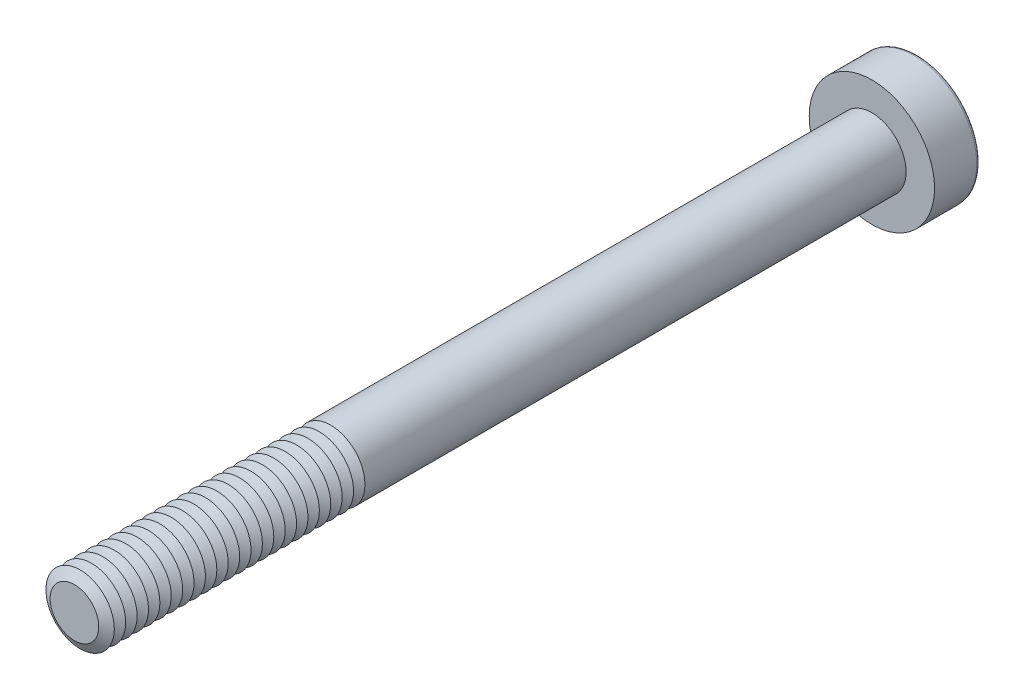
ISO-10303-21;
HEADER;
FILE_DESCRIPTION(('STEP AP214'),'2;1');
FILE_NAME('part.step','',(''),(''),'','','');
FILE_SCHEMA(('AUTOMOTIVE_DESIGN { 1 0 10303 214 1 1 1 1 }'));
ENDSEC;
DATA;
#1=APPLICATION_CONTEXT('core data for automotive mechanical design processes');
#2=APPLICATION_PROTOCOL_DEFINITION('international standard','automotive_design',2000,#1);
#3=PRODUCT_CONTEXT('',#1,'mechanical');
#4=PRODUCT('Part','Part','',(#3));
#5=PRODUCT_RELATED_PRODUCT_CATEGORY('part','',(#4));
#6=PRODUCT_DEFINITION_FORMATION('','',#4);
#7=PRODUCT_DEFINITION_CONTEXT('part definition',#1,'design');
#8=PRODUCT_DEFINITION('design','',#6,#7);
#9=PRODUCT_DEFINITION_SHAPE('','',#8);
#10=(LENGTH_UNIT() NAMED_UNIT(*) SI_UNIT(.MILLI.,.METRE.));
#11=(NAMED_UNIT(*) PLANE_ANGLE_UNIT() SI_UNIT($,.RADIAN.));
#12=(NAMED_UNIT(*) SI_UNIT($,.STERADIAN.) SOLID_ANGLE_UNIT());
#13=UNCERTAINTY_MEASURE_WITH_UNIT(LENGTH_MEASURE(1.E-05),#10,'distance_accuracy_value','');
#14=(GEOMETRIC_REPRESENTATION_CONTEXT(3) GLOBAL_UNCERTAINTY_ASSIGNED_CONTEXT((#13)) GLOBAL_UNIT_ASSIGNED_CONTEXT((#10,
#11,#12)) REPRESENTATION_CONTEXT('',''));
#15=CARTESIAN_POINT('',(0.,0.,0.));
#16=DIRECTION('',(0.,0.,1.));
#17=DIRECTION('',(1.,0.,0.));
#18=AXIS2_PLACEMENT_3D('',#15,#16,#17);
#19=CARTESIAN_POINT('',(0.,0.,33.25));
#20=DIRECTION('',(0.,0.,1.));
#21=DIRECTION('',(1.,0.,0.));
#22=AXIS2_PLACEMENT_3D('',#19,#20,#21);
#23=CONICAL_SURFACE('',#22,1.5,1.0471975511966);
#24=CARTESIAN_POINT('',(0.,0.,33.));
#25=DIRECTION('',(0.,0.,1.));
#26=DIRECTION('',(1.,0.,0.));
#27=AXIS2_PLACEMENT_3D('',#24,#25,#26);
#28=CIRCLE('',#27,1.06698729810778);
#29=CARTESIAN_POINT('',(1.06698729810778,0.,33.));
#30=VERTEX_POINT('',#29);
#31=EDGE_CURVE('E312',#30,#30,#28,.T.);
#32=ORIENTED_EDGE('',*,*,#31,.T.);
#33=EDGE_LOOP('',(#32));
#34=FACE_BOUND('',#33,.T.);
#35=CARTESIAN_POINT('',(0.,0.,33.25));
#36=DIRECTION('',(0.,0.,1.));
#37=DIRECTION('',(1.,0.,0.));
#38=AXIS2_PLACEMENT_3D('',#35,#36,#37);
#39=CIRCLE('',#38,1.5);
#40=CARTESIAN_POINT('',(1.5,0.,33.25));
#41=VERTEX_POINT('',#40);
#42=EDGE_CURVE('E315',#41,#41,#39,.T.);
#43=ORIENTED_EDGE('',*,*,#42,.F.);
#44=EDGE_LOOP('',(#43));
#45=FACE_BOUND('',#44,.T.);
#46=ADVANCED_FACE('F39',(#34,#45),#23,.T.);
#47=CARTESIAN_POINT('',(0.,0.,33.));
#48=DIRECTION('',(0.,0.,-1.));
#49=DIRECTION('',(-1.,0.,0.));
#50=AXIS2_PLACEMENT_3D('',#47,#48,#49);
#51=CONICAL_SURFACE('',#50,1.06698729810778,1.0471975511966);
#52=CARTESIAN_POINT('',(0.,0.,32.75));
#53=DIRECTION('',(0.,0.,1.));
#54=DIRECTION('',(1.,0.,0.));
#55=AXIS2_PLACEMENT_3D('',#52,#53,#54);
#56=CIRCLE('',#55,1.5);
#57=CARTESIAN_POINT('',(1.5,0.,32.75));
#58=VERTEX_POINT('',#57);
#59=EDGE_CURVE('E323',#58,#58,#56,.T.);
#60=ORIENTED_EDGE('',*,*,#59,.T.);
#61=EDGE_LOOP('',(#60));
#62=FACE_BOUND('',#61,.T.);
#63=ORIENTED_EDGE('',*,*,#31,.F.);
#64=EDGE_LOOP('',(#63));
#65=FACE_BOUND('',#64,.T.);
#66=ADVANCED_FACE('F244',(#62,#65),#51,.T.);
#67=CARTESIAN_POINT('',(0.,0.,35.));
#68=DIRECTION('',(0.,0.,1.));
#69=DIRECTION('',(1.,0.,0.));
#70=AXIS2_PLACEMENT_3D('',#67,#68,#69);
#71=PLANE('',#70);
#72=CARTESIAN_POINT('',(0.,0.,35.));
#73=DIRECTION('',(0.,0.,1.));
#74=DIRECTION('',(1.,0.,0.));
#75=AXIS2_PLACEMENT_3D('',#72,#73,#74);
#76=CIRCLE('',#75,1.06698729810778);
#77=CARTESIAN_POINT('',(1.06698729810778,0.,35.));
#78=VERTEX_POINT('',#77);
#79=EDGE_CURVE('E173',#78,#78,#76,.T.);
#80=ORIENTED_EDGE('',*,*,#79,.T.);
#81=EDGE_LOOP('',(#80));
#82=FACE_BOUND('',#81,.T.);
#83=ADVANCED_FACE('F250',(#82),#71,.T.);
#84=CARTESIAN_POINT('',(0.,0.,35.));
#85=DIRECTION('',(0.,0.,-1.));
#86=DIRECTION('',(-1.,0.,0.));
#87=AXIS2_PLACEMENT_3D('',#84,#85,#86);
#88=CONICAL_SURFACE('',#87,1.06698729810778,1.0471975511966);
#89=CARTESIAN_POINT('',(0.,0.,34.75));
#90=DIRECTION('',(0.,0.,1.));
#91=DIRECTION('',(1.,0.,0.));
#92=AXIS2_PLACEMENT_3D('',#89,#90,#91);
#93=CIRCLE('',#92,1.5);
#94=CARTESIAN_POINT('',(1.5,0.,34.75));
#95=VERTEX_POINT('',#94);
#96=EDGE_CURVE('E290',#95,#95,#93,.T.);
#97=ORIENTED_EDGE('',*,*,#96,.T.);
#98=EDGE_LOOP('',(#97));
#99=FACE_BOUND('',#98,.T.);
#100=ORIENTED_EDGE('',*,*,#79,.F.);
#101=EDGE_LOOP('',(#100));
#102=FACE_BOUND('',#101,.T.);
#103=ADVANCED_FACE('F198',(#99,#102),#88,.T.);
#104=CARTESIAN_POINT('',(0.,0.,34.75));
#105=DIRECTION('',(0.,0.,1.));
#106=DIRECTION('',(1.,0.,0.));
#107=AXIS2_PLACEMENT_3D('',#104,#105,#106);
#108=CONICAL_SURFACE('',#107,1.5,1.0471975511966);
#109=CARTESIAN_POINT('',(0.,0.,34.5));
#110=DIRECTION('',(0.,0.,1.));
#111=DIRECTION('',(1.,0.,0.));
#112=AXIS2_PLACEMENT_3D('',#109,#110,#111);
#113=CIRCLE('',#112,1.06698729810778);
#114=CARTESIAN_POINT('',(1.06698729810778,0.,34.5));
#115=VERTEX_POINT('',#114);
#116=EDGE_CURVE('E287',#115,#115,#113,.T.);
#117=ORIENTED_EDGE('',*,*,#116,.T.);
#118=EDGE_LOOP('',(#117));
#119=FACE_BOUND('',#118,.T.);
#120=ORIENTED_EDGE('',*,*,#96,.F.);
#121=EDGE_LOOP('',(#120));
#122=FACE_BOUND('',#121,.T.);
#123=ADVANCED_FACE('F276',(#119,#122),#108,.T.);
#124=CARTESIAN_POINT('',(0.,0.,34.5));
#125=DIRECTION('',(0.,0.,-1.));
#126=DIRECTION('',(-1.,0.,0.));
#127=AXIS2_PLACEMENT_3D('',#124,#125,#126);
#128=CONICAL_SURFACE('',#127,1.06698729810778,1.0471975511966);
#129=CARTESIAN_POINT('',(0.,0.,34.25));
#130=DIRECTION('',(0.,0.,1.));
#131=DIRECTION('',(1.,0.,0.));
#132=AXIS2_PLACEMENT_3D('',#129,#130,#131);
#133=CIRCLE('',#132,1.5);
#134=CARTESIAN_POINT('',(1.5,0.,34.25));
#135=VERTEX_POINT('',#134);
#136=EDGE_CURVE('E298',#135,#135,#133,.T.);
#137=ORIENTED_EDGE('',*,*,#136,.T.);
#138=EDGE_LOOP('',(#137));
#139=FACE_BOUND('',#138,.T.);
#140=ORIENTED_EDGE('',*,*,#116,.F.);
#141=EDGE_LOOP('',(#140));
#142=FACE_BOUND('',#141,.T.);
#143=ADVANCED_FACE('F273',(#139,#142),#128,.T.);
#144=CARTESIAN_POINT('',(0.,0.,34.25));
#145=DIRECTION('',(0.,0.,1.));
#146=DIRECTION('',(1.,0.,0.));
#147=AXIS2_PLACEMENT_3D('',#144,#145,#146);
#148=CONICAL_SURFACE('',#147,1.5,1.0471975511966);
#149=CARTESIAN_POINT('',(0.,0.,34.));
#150=DIRECTION('',(0.,0.,1.));
#151=DIRECTION('',(1.,0.,0.));
#152=AXIS2_PLACEMENT_3D('',#149,#150,#151);
#153=CIRCLE('',#152,1.06698729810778);
#154=CARTESIAN_POINT('',(1.06698729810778,0.,34.));
#155=VERTEX_POINT('',#154);
#156=EDGE_CURVE('E292',#155,#155,#153,.T.);
#157=ORIENTED_EDGE('',*,*,#156,.T.);
#158=EDGE_LOOP('',(#157));
#159=FACE_BOUND('',#158,.T.);
#160=ORIENTED_EDGE('',*,*,#136,.F.);
#161=EDGE_LOOP('',(#160));
#162=FACE_BOUND('',#161,.T.);
#163=ADVANCED_FACE('F269',(#159,#162),#148,.T.);
#164=CARTESIAN_POINT('',(0.,0.,34.));
#165=DIRECTION('',(0.,0.,-1.));
#166=DIRECTION('',(-1.,0.,0.));
#167=AXIS2_PLACEMENT_3D('',#164,#165,#166);
#168=CONICAL_SURFACE('',#167,1.06698729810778,1.0471975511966);
#169=CARTESIAN_POINT('',(0.,0.,33.75));
#170=DIRECTION('',(0.,0.,1.));
#171=DIRECTION('',(1.,0.,0.));
#172=AXIS2_PLACEMENT_3D('',#169,#170,#171);
#173=CIRCLE('',#172,1.5);
#174=CARTESIAN_POINT('',(1.5,0.,33.75));
#175=VERTEX_POINT('',#174);
#176=EDGE_CURVE('E308',#175,#175,#173,.T.);
#177=ORIENTED_EDGE('',*,*,#176,.T.);
#178=EDGE_LOOP('',(#177));
#179=FACE_BOUND('',#178,.T.);
#180=ORIENTED_EDGE('',*,*,#156,.F.);
#181=EDGE_LOOP('',(#180));
#182=FACE_BOUND('',#181,.T.);
#183=ADVANCED_FACE('F265',(#179,#182),#168,.T.);
#184=CARTESIAN_POINT('',(0.,0.,33.75));
#185=DIRECTION('',(0.,0.,1.));
#186=DIRECTION('',(1.,0.,0.));
#187=AXIS2_PLACEMENT_3D('',#184,#185,#186);
#188=CONICAL_SURFACE('',#187,1.5,1.0471975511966);
#189=CARTESIAN_POINT('',(0.,0.,33.5));
#190=DIRECTION('',(0.,0.,1.));
#191=DIRECTION('',(1.,0.,0.));
#192=AXIS2_PLACEMENT_3D('',#189,#190,#191);
#193=CIRCLE('',#192,1.06698729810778);
#194=CARTESIAN_POINT('',(1.06698729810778,0.,33.5));
#195=VERTEX_POINT('',#194);
#196=EDGE_CURVE('E304',#195,#195,#193,.T.);
#197=ORIENTED_EDGE('',*,*,#196,.T.);
#198=EDGE_LOOP('',(#197));
#199=FACE_BOUND('',#198,.T.);
#200=ORIENTED_EDGE('',*,*,#176,.F.);
#201=EDGE_LOOP('',(#200));
#202=FACE_BOUND('',#201,.T.);
#203=ADVANCED_FACE('F261',(#199,#202),#188,.T.);
#204=CARTESIAN_POINT('',(0.,0.,33.5));
#205=DIRECTION('',(0.,0.,-1.));
#206=DIRECTION('',(-1.,0.,0.));
#207=AXIS2_PLACEMENT_3D('',#204,#205,#206);
#208=CONICAL_SURFACE('',#207,1.06698729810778,1.0471975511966);
#209=ORIENTED_EDGE('',*,*,#42,.T.);
#210=EDGE_LOOP('',(#209));
#211=FACE_BOUND('',#210,.T.);
#212=ORIENTED_EDGE('',*,*,#196,.F.);
#213=EDGE_LOOP('',(#212));
#214=FACE_BOUND('',#213,.T.);
#215=ADVANCED_FACE('F257',(#211,#214),#208,.T.);
#216=CARTESIAN_POINT('',(0.,0.,32.75));
#217=DIRECTION('',(0.,0.,1.));
#218=DIRECTION('',(1.,0.,0.));
#219=AXIS2_PLACEMENT_3D('',#216,#217,#218);
#220=CONICAL_SURFACE('',#219,1.5,1.0471975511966);
#221=CARTESIAN_POINT('',(0.,0.,32.5));
#222=DIRECTION('',(0.,0.,1.));
#223=DIRECTION('',(1.,0.,0.));
#224=AXIS2_PLACEMENT_3D('',#221,#222,#223);
#225=CIRCLE('',#224,1.06698729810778);
#226=CARTESIAN_POINT('',(1.06698729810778,0.,32.5));
#227=VERTEX_POINT('',#226);
#228=EDGE_CURVE('E319',#227,#227,#225,.T.);
#229=ORIENTED_EDGE('',*,*,#228,.T.);
#230=EDGE_LOOP('',(#229));
#231=FACE_BOUND('',#230,.T.);
#232=ORIENTED_EDGE('',*,*,#59,.F.);
#233=EDGE_LOOP('',(#232));
#234=FACE_BOUND('',#233,.T.);
#235=ADVANCED_FACE('F260',(#231,#234),#220,.T.);
#236=CARTESIAN_POINT('',(0.,0.,32.5));
#237=DIRECTION('',(0.,0.,-1.));
#238=DIRECTION('',(-1.,0.,0.));
#239=AXIS2_PLACEMENT_3D('',#236,#237,#238);
#240=CONICAL_SURFACE('',#239,1.06698729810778,1.0471975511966);
#241=CARTESIAN_POINT('',(0.,0.,32.25));
#242=DIRECTION('',(0.,0.,1.));
#243=DIRECTION('',(1.,0.,0.));
#244=AXIS2_PLACEMENT_3D('',#241,#242,#243);
#245=CIRCLE('',#244,1.5);
#246=CARTESIAN_POINT('',(1.5,0.,32.25));
#247=VERTEX_POINT('',#246);
#248=EDGE_CURVE('E331',#247,#247,#245,.T.);
#249=ORIENTED_EDGE('',*,*,#248,.T.);
#250=EDGE_LOOP('',(#249));
#251=FACE_BOUND('',#250,.T.);
#252=ORIENTED_EDGE('',*,*,#228,.F.);
#253=EDGE_LOOP('',(#252));
#254=FACE_BOUND('',#253,.T.);
#255=ADVANCED_FACE('F606',(#251,#254),#240,.T.);
#256=CARTESIAN_POINT('',(0.,0.,32.25));
#257=DIRECTION('',(0.,0.,1.));
#258=DIRECTION('',(1.,0.,0.));
#259=AXIS2_PLACEMENT_3D('',#256,#257,#258);
#260=CONICAL_SURFACE('',#259,1.5,1.0471975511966);
#261=CARTESIAN_POINT('',(0.,0.,32.));
#262=DIRECTION('',(0.,0.,1.));
#263=DIRECTION('',(1.,0.,0.));
#264=AXIS2_PLACEMENT_3D('',#261,#262,#263);
#265=CIRCLE('',#264,1.06698729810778);
#266=CARTESIAN_POINT('',(1.06698729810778,0.,32.));
#267=VERTEX_POINT('',#266);
#268=EDGE_CURVE('E327',#267,#267,#265,.T.);
#269=ORIENTED_EDGE('',*,*,#268,.T.);
#270=EDGE_LOOP('',(#269));
#271=FACE_BOUND('',#270,.T.);
#272=ORIENTED_EDGE('',*,*,#248,.F.);
#273=EDGE_LOOP('',(#272));
#274=FACE_BOUND('',#273,.T.);
#275=ADVANCED_FACE('F602',(#271,#274),#260,.T.);
#276=CARTESIAN_POINT('',(0.,0.,32.));
#277=DIRECTION('',(0.,0.,-1.));
#278=DIRECTION('',(-1.,0.,0.));
#279=AXIS2_PLACEMENT_3D('',#276,#277,#278);
#280=CONICAL_SURFACE('',#279,1.06698729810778,1.0471975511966);
#281=CARTESIAN_POINT('',(0.,0.,31.75));
#282=DIRECTION('',(0.,0.,1.));
#283=DIRECTION('',(1.,0.,0.));
#284=AXIS2_PLACEMENT_3D('',#281,#282,#283);
#285=CIRCLE('',#284,1.5);
#286=CARTESIAN_POINT('',(1.5,0.,31.75));
#287=VERTEX_POINT('',#286);
#288=EDGE_CURVE('E339',#287,#287,#285,.T.);
#289=ORIENTED_EDGE('',*,*,#288,.T.);
#290=EDGE_LOOP('',(#289));
#291=FACE_BOUND('',#290,.T.);
#292=ORIENTED_EDGE('',*,*,#268,.F.);
#293=EDGE_LOOP('',(#292));
#294=FACE_BOUND('',#293,.T.);
#295=ADVANCED_FACE('F598',(#291,#294),#280,.T.);
#296=CARTESIAN_POINT('',(0.,0.,31.75));
#297=DIRECTION('',(0.,0.,1.));
#298=DIRECTION('',(1.,0.,0.));
#299=AXIS2_PLACEMENT_3D('',#296,#297,#298);
#300=CONICAL_SURFACE('',#299,1.5,1.0471975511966);
#301=CARTESIAN_POINT('',(0.,0.,31.5));
#302=DIRECTION('',(0.,0.,1.));
#303=DIRECTION('',(1.,0.,0.));
#304=AXIS2_PLACEMENT_3D('',#301,#302,#303);
#305=CIRCLE('',#304,1.06698729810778);
#306=CARTESIAN_POINT('',(1.06698729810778,0.,31.5));
#307=VERTEX_POINT('',#306);
#308=EDGE_CURVE('E335',#307,#307,#305,.T.);
#309=ORIENTED_EDGE('',*,*,#308,.T.);
#310=EDGE_LOOP('',(#309));
#311=FACE_BOUND('',#310,.T.);
#312=ORIENTED_EDGE('',*,*,#288,.F.);
#313=EDGE_LOOP('',(#312));
#314=FACE_BOUND('',#313,.T.);
#315=ADVANCED_FACE('F594',(#311,#314),#300,.T.);
#316=CARTESIAN_POINT('',(0.,0.,31.5));
#317=DIRECTION('',(0.,0.,-1.));
#318=DIRECTION('',(-1.,0.,0.));
#319=AXIS2_PLACEMENT_3D('',#316,#317,#318);
#320=CONICAL_SURFACE('',#319,1.06698729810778,1.0471975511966);
#321=CARTESIAN_POINT('',(0.,0.,31.25));
#322=DIRECTION('',(0.,0.,1.));
#323=DIRECTION('',(1.,0.,0.));
#324=AXIS2_PLACEMENT_3D('',#321,#322,#323);
#325=CIRCLE('',#324,1.5);
#326=CARTESIAN_POINT('',(1.5,0.,31.25));
#327=VERTEX_POINT('',#326);
#328=EDGE_CURVE('E347',#327,#327,#325,.T.);
#329=ORIENTED_EDGE('',*,*,#328,.T.);
#330=EDGE_LOOP('',(#329));
#331=FACE_BOUND('',#330,.T.);
#332=ORIENTED_EDGE('',*,*,#308,.F.);
#333=EDGE_LOOP('',(#332));
#334=FACE_BOUND('',#333,.T.);
#335=ADVANCED_FACE('F590',(#331,#334),#320,.T.);
#336=CARTESIAN_POINT('',(0.,0.,31.25));
#337=DIRECTION('',(0.,0.,1.));
#338=DIRECTION('',(1.,0.,0.));
#339=AXIS2_PLACEMENT_3D('',#336,#337,#338);
#340=CONICAL_SURFACE('',#339,1.5,1.0471975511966);
#341=CARTESIAN_POINT('',(0.,0.,31.));
#342=DIRECTION('',(0.,0.,1.));
#343=DIRECTION('',(1.,0.,0.));
#344=AXIS2_PLACEMENT_3D('',#341,#342,#343);
#345=CIRCLE('',#344,1.06698729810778);
#346=CARTESIAN_POINT('',(1.06698729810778,0.,31.));
#347=VERTEX_POINT('',#346);
#348=EDGE_CURVE('E343',#347,#347,#345,.T.);
#349=ORIENTED_EDGE('',*,*,#348,.T.);
#350=EDGE_LOOP('',(#349));
#351=FACE_BOUND('',#350,.T.);
#352=ORIENTED_EDGE('',*,*,#328,.F.);
#353=EDGE_LOOP('',(#352));
#354=FACE_BOUND('',#353,.T.);
#355=ADVANCED_FACE('F586',(#351,#354),#340,.T.);
#356=CARTESIAN_POINT('',(0.,0.,31.));
#357=DIRECTION('',(0.,0.,-1.));
#358=DIRECTION('',(-1.,0.,0.));
#359=AXIS2_PLACEMENT_3D('',#356,#357,#358);
#360=CONICAL_SURFACE('',#359,1.06698729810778,1.0471975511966);
#361=CARTESIAN_POINT('',(0.,0.,30.75));
#362=DIRECTION('',(0.,0.,1.));
#363=DIRECTION('',(1.,0.,0.));
#364=AXIS2_PLACEMENT_3D('',#361,#362,#363);
#365=CIRCLE('',#364,1.5);
#366=CARTESIAN_POINT('',(1.5,0.,30.75));
#367=VERTEX_POINT('',#366);
#368=EDGE_CURVE('E355',#367,#367,#365,.T.);
#369=ORIENTED_EDGE('',*,*,#368,.T.);
#370=EDGE_LOOP('',(#369));
#371=FACE_BOUND('',#370,.T.);
#372=ORIENTED_EDGE('',*,*,#348,.F.);
#373=EDGE_LOOP('',(#372));
#374=FACE_BOUND('',#373,.T.);
#375=ADVANCED_FACE('F582',(#371,#374),#360,.T.);
#376=CARTESIAN_POINT('',(0.,0.,30.75));
#377=DIRECTION('',(0.,0.,1.));
#378=DIRECTION('',(1.,0.,0.));
#379=AXIS2_PLACEMENT_3D('',#376,#377,#378);
#380=CONICAL_SURFACE('',#379,1.5,1.0471975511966);
#381=CARTESIAN_POINT('',(0.,0.,30.5));
#382=DIRECTION('',(0.,0.,1.));
#383=DIRECTION('',(1.,0.,0.));
#384=AXIS2_PLACEMENT_3D('',#381,#382,#383);
#385=CIRCLE('',#384,1.06698729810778);
#386=CARTESIAN_POINT('',(1.06698729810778,0.,30.5));
#387=VERTEX_POINT('',#386);
#388=EDGE_CURVE('E351',#387,#387,#385,.T.);
#389=ORIENTED_EDGE('',*,*,#388,.T.);
#390=EDGE_LOOP('',(#389));
#391=FACE_BOUND('',#390,.T.);
#392=ORIENTED_EDGE('',*,*,#368,.F.);
#393=EDGE_LOOP('',(#392));
#394=FACE_BOUND('',#393,.T.);
#395=ADVANCED_FACE('F578',(#391,#394),#380,.T.);
#396=CARTESIAN_POINT('',(0.,0.,30.5));
#397=DIRECTION('',(0.,0.,-1.));
#398=DIRECTION('',(-1.,0.,0.));
#399=AXIS2_PLACEMENT_3D('',#396,#397,#398);
#400=CONICAL_SURFACE('',#399,1.06698729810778,1.0471975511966);
#401=CARTESIAN_POINT('',(0.,0.,30.25));
#402=DIRECTION('',(0.,0.,1.));
#403=DIRECTION('',(1.,0.,0.));
#404=AXIS2_PLACEMENT_3D('',#401,#402,#403);
#405=CIRCLE('',#404,1.5);
#406=CARTESIAN_POINT('',(1.5,0.,30.25));
#407=VERTEX_POINT('',#406);
#408=EDGE_CURVE('E363',#407,#407,#405,.T.);
#409=ORIENTED_EDGE('',*,*,#408,.T.);
#410=EDGE_LOOP('',(#409));
#411=FACE_BOUND('',#410,.T.);
#412=ORIENTED_EDGE('',*,*,#388,.F.);
#413=EDGE_LOOP('',(#412));
#414=FACE_BOUND('',#413,.T.);
#415=ADVANCED_FACE('F574',(#411,#414),#400,.T.);
#416=CARTESIAN_POINT('',(0.,0.,30.25));
#417=DIRECTION('',(0.,0.,1.));
#418=DIRECTION('',(1.,0.,0.));
#419=AXIS2_PLACEMENT_3D('',#416,#417,#418);
#420=CONICAL_SURFACE('',#419,1.5,1.0471975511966);
#421=CARTESIAN_POINT('',(0.,0.,30.));
#422=DIRECTION('',(0.,0.,1.));
#423=DIRECTION('',(1.,0.,0.));
#424=AXIS2_PLACEMENT_3D('',#421,#422,#423);
#425=CIRCLE('',#424,1.06698729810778);
#426=CARTESIAN_POINT('',(1.06698729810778,0.,30.));
#427=VERTEX_POINT('',#426);
#428=EDGE_CURVE('E359',#427,#427,#425,.T.);
#429=ORIENTED_EDGE('',*,*,#428,.T.);
#430=EDGE_LOOP('',(#429));
#431=FACE_BOUND('',#430,.T.);
#432=ORIENTED_EDGE('',*,*,#408,.F.);
#433=EDGE_LOOP('',(#432));
#434=FACE_BOUND('',#433,.T.);
#435=ADVANCED_FACE('F570',(#431,#434),#420,.T.);
#436=CARTESIAN_POINT('',(0.,0.,30.));
#437=DIRECTION('',(0.,0.,-1.));
#438=DIRECTION('',(-1.,0.,0.));
#439=AXIS2_PLACEMENT_3D('',#436,#437,#438);
#440=CONICAL_SURFACE('',#439,1.06698729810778,1.0471975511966);
#441=CARTESIAN_POINT('',(0.,0.,29.75));
#442=DIRECTION('',(0.,0.,1.));
#443=DIRECTION('',(1.,0.,0.));
#444=AXIS2_PLACEMENT_3D('',#441,#442,#443);
#445=CIRCLE('',#444,1.5);
#446=CARTESIAN_POINT('',(1.5,0.,29.75));
#447=VERTEX_POINT('',#446);
#448=EDGE_CURVE('E371',#447,#447,#445,.T.);
#449=ORIENTED_EDGE('',*,*,#448,.T.);
#450=EDGE_LOOP('',(#449));
#451=FACE_BOUND('',#450,.T.);
#452=ORIENTED_EDGE('',*,*,#428,.F.);
#453=EDGE_LOOP('',(#452));
#454=FACE_BOUND('',#453,.T.);
#455=ADVANCED_FACE('F566',(#451,#454),#440,.T.);
#456=CARTESIAN_POINT('',(0.,0.,29.75));
#457=DIRECTION('',(0.,0.,1.));
#458=DIRECTION('',(1.,0.,0.));
#459=AXIS2_PLACEMENT_3D('',#456,#457,#458);
#460=CONICAL_SURFACE('',#459,1.5,1.0471975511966);
#461=CARTESIAN_POINT('',(0.,0.,29.5));
#462=DIRECTION('',(0.,0.,1.));
#463=DIRECTION('',(1.,0.,0.));
#464=AXIS2_PLACEMENT_3D('',#461,#462,#463);
#465=CIRCLE('',#464,1.06698729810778);
#466=CARTESIAN_POINT('',(1.06698729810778,0.,29.5));
#467=VERTEX_POINT('',#466);
#468=EDGE_CURVE('E367',#467,#467,#465,.T.);
#469=ORIENTED_EDGE('',*,*,#468,.T.);
#470=EDGE_LOOP('',(#469));
#471=FACE_BOUND('',#470,.T.);
#472=ORIENTED_EDGE('',*,*,#448,.F.);
#473=EDGE_LOOP('',(#472));
#474=FACE_BOUND('',#473,.T.);
#475=ADVANCED_FACE('F562',(#471,#474),#460,.T.);
#476=CARTESIAN_POINT('',(0.,0.,29.5));
#477=DIRECTION('',(0.,0.,-1.));
#478=DIRECTION('',(-1.,0.,0.));
#479=AXIS2_PLACEMENT_3D('',#476,#477,#478);
#480=CONICAL_SURFACE('',#479,1.06698729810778,1.0471975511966);
#481=CARTESIAN_POINT('',(0.,0.,29.25));
#482=DIRECTION('',(0.,0.,1.));
#483=DIRECTION('',(1.,0.,0.));
#484=AXIS2_PLACEMENT_3D('',#481,#482,#483);
#485=CIRCLE('',#484,1.5);
#486=CARTESIAN_POINT('',(1.5,0.,29.25));
#487=VERTEX_POINT('',#486);
#488=EDGE_CURVE('E379',#487,#487,#485,.T.);
#489=ORIENTED_EDGE('',*,*,#488,.T.);
#490=EDGE_LOOP('',(#489));
#491=FACE_BOUND('',#490,.T.);
#492=ORIENTED_EDGE('',*,*,#468,.F.);
#493=EDGE_LOOP('',(#492));
#494=FACE_BOUND('',#493,.T.);
#495=ADVANCED_FACE('F558',(#491,#494),#480,.T.);
#496=CARTESIAN_POINT('',(0.,0.,29.25));
#497=DIRECTION('',(0.,0.,1.));
#498=DIRECTION('',(1.,0.,0.));
#499=AXIS2_PLACEMENT_3D('',#496,#497,#498);
#500=CONICAL_SURFACE('',#499,1.5,1.0471975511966);
#501=CARTESIAN_POINT('',(0.,0.,29.));
#502=DIRECTION('',(0.,0.,1.));
#503=DIRECTION('',(1.,0.,0.));
#504=AXIS2_PLACEMENT_3D('',#501,#502,#503);
#505=CIRCLE('',#504,1.06698729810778);
#506=CARTESIAN_POINT('',(1.06698729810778,0.,29.));
#507=VERTEX_POINT('',#506);
#508=EDGE_CURVE('E375',#507,#507,#505,.T.);
#509=ORIENTED_EDGE('',*,*,#508,.T.);
#510=EDGE_LOOP('',(#509));
#511=FACE_BOUND('',#510,.T.);
#512=ORIENTED_EDGE('',*,*,#488,.F.);
#513=EDGE_LOOP('',(#512));
#514=FACE_BOUND('',#513,.T.);
#515=ADVANCED_FACE('F554',(#511,#514),#500,.T.);
#516=CARTESIAN_POINT('',(0.,0.,29.));
#517=DIRECTION('',(0.,0.,-1.));
#518=DIRECTION('',(-1.,0.,0.));
#519=AXIS2_PLACEMENT_3D('',#516,#517,#518);
#520=CONICAL_SURFACE('',#519,1.06698729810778,1.0471975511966);
#521=CARTESIAN_POINT('',(0.,0.,28.75));
#522=DIRECTION('',(0.,0.,1.));
#523=DIRECTION('',(1.,0.,0.));
#524=AXIS2_PLACEMENT_3D('',#521,#522,#523);
#525=CIRCLE('',#524,1.5);
#526=CARTESIAN_POINT('',(1.5,0.,28.75));
#527=VERTEX_POINT('',#526);
#528=EDGE_CURVE('E387',#527,#527,#525,.T.);
#529=ORIENTED_EDGE('',*,*,#528,.T.);
#530=EDGE_LOOP('',(#529));
#531=FACE_BOUND('',#530,.T.);
#532=ORIENTED_EDGE('',*,*,#508,.F.);
#533=EDGE_LOOP('',(#532));
#534=FACE_BOUND('',#533,.T.);
#535=ADVANCED_FACE('F550',(#531,#534),#520,.T.);
#536=CARTESIAN_POINT('',(0.,0.,28.75));
#537=DIRECTION('',(0.,0.,1.));
#538=DIRECTION('',(1.,0.,0.));
#539=AXIS2_PLACEMENT_3D('',#536,#537,#538);
#540=CONICAL_SURFACE('',#539,1.5,1.0471975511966);
#541=CARTESIAN_POINT('',(0.,0.,28.5));
#542=DIRECTION('',(0.,0.,1.));
#543=DIRECTION('',(1.,0.,0.));
#544=AXIS2_PLACEMENT_3D('',#541,#542,#543);
#545=CIRCLE('',#544,1.06698729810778);
#546=CARTESIAN_POINT('',(1.06698729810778,0.,28.5));
#547=VERTEX_POINT('',#546);
#548=EDGE_CURVE('E383',#547,#547,#545,.T.);
#549=ORIENTED_EDGE('',*,*,#548,.T.);
#550=EDGE_LOOP('',(#549));
#551=FACE_BOUND('',#550,.T.);
#552=ORIENTED_EDGE('',*,*,#528,.F.);
#553=EDGE_LOOP('',(#552));
#554=FACE_BOUND('',#553,.T.);
#555=ADVANCED_FACE('F546',(#551,#554),#540,.T.);
#556=CARTESIAN_POINT('',(0.,0.,28.5));
#557=DIRECTION('',(0.,0.,-1.));
#558=DIRECTION('',(-1.,0.,0.));
#559=AXIS2_PLACEMENT_3D('',#556,#557,#558);
#560=CONICAL_SURFACE('',#559,1.06698729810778,1.0471975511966);
#561=CARTESIAN_POINT('',(0.,0.,28.25));
#562=DIRECTION('',(0.,0.,1.));
#563=DIRECTION('',(1.,0.,0.));
#564=AXIS2_PLACEMENT_3D('',#561,#562,#563);
#565=CIRCLE('',#564,1.5);
#566=CARTESIAN_POINT('',(1.5,0.,28.25));
#567=VERTEX_POINT('',#566);
#568=EDGE_CURVE('E395',#567,#567,#565,.T.);
#569=ORIENTED_EDGE('',*,*,#568,.T.);
#570=EDGE_LOOP('',(#569));
#571=FACE_BOUND('',#570,.T.);
#572=ORIENTED_EDGE('',*,*,#548,.F.);
#573=EDGE_LOOP('',(#572));
#574=FACE_BOUND('',#573,.T.);
#575=ADVANCED_FACE('F542',(#571,#574),#560,.T.);
#576=CARTESIAN_POINT('',(0.,0.,28.25));
#577=DIRECTION('',(0.,0.,1.));
#578=DIRECTION('',(1.,0.,0.));
#579=AXIS2_PLACEMENT_3D('',#576,#577,#578);
#580=CONICAL_SURFACE('',#579,1.5,1.0471975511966);
#581=CARTESIAN_POINT('',(0.,0.,28.));
#582=DIRECTION('',(0.,0.,1.));
#583=DIRECTION('',(1.,0.,0.));
#584=AXIS2_PLACEMENT_3D('',#581,#582,#583);
#585=CIRCLE('',#584,1.06698729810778);
#586=CARTESIAN_POINT('',(1.06698729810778,0.,28.));
#587=VERTEX_POINT('',#586);
#588=EDGE_CURVE('E391',#587,#587,#585,.T.);
#589=ORIENTED_EDGE('',*,*,#588,.T.);
#590=EDGE_LOOP('',(#589));
#591=FACE_BOUND('',#590,.T.);
#592=ORIENTED_EDGE('',*,*,#568,.F.);
#593=EDGE_LOOP('',(#592));
#594=FACE_BOUND('',#593,.T.);
#595=ADVANCED_FACE('F538',(#591,#594),#580,.T.);
#596=CARTESIAN_POINT('',(0.,0.,28.));
#597=DIRECTION('',(0.,0.,-1.));
#598=DIRECTION('',(-1.,0.,0.));
#599=AXIS2_PLACEMENT_3D('',#596,#597,#598);
#600=CONICAL_SURFACE('',#599,1.06698729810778,1.0471975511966);
#601=CARTESIAN_POINT('',(0.,0.,27.75));
#602=DIRECTION('',(0.,0.,1.));
#603=DIRECTION('',(1.,0.,0.));
#604=AXIS2_PLACEMENT_3D('',#601,#602,#603);
#605=CIRCLE('',#604,1.5);
#606=CARTESIAN_POINT('',(1.5,0.,27.75));
#607=VERTEX_POINT('',#606);
#608=EDGE_CURVE('E403',#607,#607,#605,.T.);
#609=ORIENTED_EDGE('',*,*,#608,.T.);
#610=EDGE_LOOP('',(#609));
#611=FACE_BOUND('',#610,.T.);
#612=ORIENTED_EDGE('',*,*,#588,.F.);
#613=EDGE_LOOP('',(#612));
#614=FACE_BOUND('',#613,.T.);
#615=ADVANCED_FACE('F534',(#611,#614),#600,.T.);
#616=CARTESIAN_POINT('',(0.,0.,27.75));
#617=DIRECTION('',(0.,0.,1.));
#618=DIRECTION('',(1.,0.,0.));
#619=AXIS2_PLACEMENT_3D('',#616,#617,#618);
#620=CONICAL_SURFACE('',#619,1.5,1.0471975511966);
#621=CARTESIAN_POINT('',(0.,0.,27.5));
#622=DIRECTION('',(0.,0.,1.));
#623=DIRECTION('',(1.,0.,0.));
#624=AXIS2_PLACEMENT_3D('',#621,#622,#623);
#625=CIRCLE('',#624,1.06698729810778);
#626=CARTESIAN_POINT('',(1.06698729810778,0.,27.5));
#627=VERTEX_POINT('',#626);
#628=EDGE_CURVE('E399',#627,#627,#625,.T.);
#629=ORIENTED_EDGE('',*,*,#628,.T.);
#630=EDGE_LOOP('',(#629));
#631=FACE_BOUND('',#630,.T.);
#632=ORIENTED_EDGE('',*,*,#608,.F.);
#633=EDGE_LOOP('',(#632));
#634=FACE_BOUND('',#633,.T.);
#635=ADVANCED_FACE('F530',(#631,#634),#620,.T.);
#636=CARTESIAN_POINT('',(0.,0.,27.5));
#637=DIRECTION('',(0.,0.,-1.));
#638=DIRECTION('',(-1.,0.,0.));
#639=AXIS2_PLACEMENT_3D('',#636,#637,#638);
#640=CONICAL_SURFACE('',#639,1.06698729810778,1.0471975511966);
#641=CARTESIAN_POINT('',(0.,0.,27.25));
#642=DIRECTION('',(0.,0.,1.));
#643=DIRECTION('',(1.,0.,0.));
#644=AXIS2_PLACEMENT_3D('',#641,#642,#643);
#645=CIRCLE('',#644,1.5);
#646=CARTESIAN_POINT('',(1.5,0.,27.25));
#647=VERTEX_POINT('',#646);
#648=EDGE_CURVE('E410',#647,#647,#645,.T.);
#649=ORIENTED_EDGE('',*,*,#648,.T.);
#650=EDGE_LOOP('',(#649));
#651=FACE_BOUND('',#650,.T.);
#652=ORIENTED_EDGE('',*,*,#628,.F.);
#653=EDGE_LOOP('',(#652));
#654=FACE_BOUND('',#653,.T.);
#655=ADVANCED_FACE('F526',(#651,#654),#640,.T.);
#656=CARTESIAN_POINT('',(0.,0.,27.25));
#657=DIRECTION('',(0.,0.,1.));
#658=DIRECTION('',(1.,0.,0.));
#659=AXIS2_PLACEMENT_3D('',#656,#657,#658);
#660=CONICAL_SURFACE('',#659,1.5,1.0471975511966);
#661=CARTESIAN_POINT('',(0.,0.,27.));
#662=DIRECTION('',(0.,0.,1.));
#663=DIRECTION('',(1.,0.,0.));
#664=AXIS2_PLACEMENT_3D('',#661,#662,#663);
#665=CIRCLE('',#664,1.06698729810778);
#666=CARTESIAN_POINT('',(1.06698729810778,0.,27.));
#667=VERTEX_POINT('',#666);
#668=EDGE_CURVE('E407',#667,#667,#665,.T.);
#669=ORIENTED_EDGE('',*,*,#668,.T.);
#670=EDGE_LOOP('',(#669));
#671=FACE_BOUND('',#670,.T.);
#672=ORIENTED_EDGE('',*,*,#648,.F.);
#673=EDGE_LOOP('',(#672));
#674=FACE_BOUND('',#673,.T.);
#675=ADVANCED_FACE('F522',(#671,#674),#660,.T.);
#676=CARTESIAN_POINT('',(0.,0.,27.));
#677=DIRECTION('',(0.,0.,-1.));
#678=DIRECTION('',(-1.,0.,0.));
#679=AXIS2_PLACEMENT_3D('',#676,#677,#678);
#680=CONICAL_SURFACE('',#679,1.06698729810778,1.0471975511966);
#681=CARTESIAN_POINT('',(0.,0.,26.75));
#682=DIRECTION('',(0.,0.,1.));
#683=DIRECTION('',(1.,0.,0.));
#684=AXIS2_PLACEMENT_3D('',#681,#682,#683);
#685=CIRCLE('',#684,1.5);
#686=CARTESIAN_POINT('',(1.5,0.,26.75));
#687=VERTEX_POINT('',#686);
#688=EDGE_CURVE('E418',#687,#687,#685,.T.);
#689=ORIENTED_EDGE('',*,*,#688,.T.);
#690=EDGE_LOOP('',(#689));
#691=FACE_BOUND('',#690,.T.);
#692=ORIENTED_EDGE('',*,*,#668,.F.);
#693=EDGE_LOOP('',(#692));
#694=FACE_BOUND('',#693,.T.);
#695=ADVANCED_FACE('F518',(#691,#694),#680,.T.);
#696=CARTESIAN_POINT('',(0.,0.,26.75));
#697=DIRECTION('',(0.,0.,1.));
#698=DIRECTION('',(1.,0.,0.));
#699=AXIS2_PLACEMENT_3D('',#696,#697,#698);
#700=CONICAL_SURFACE('',#699,1.5,1.0471975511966);
#701=CARTESIAN_POINT('',(0.,0.,26.5));
#702=DIRECTION('',(0.,0.,1.));
#703=DIRECTION('',(1.,0.,0.));
#704=AXIS2_PLACEMENT_3D('',#701,#702,#703);
#705=CIRCLE('',#704,1.06698729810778);
#706=CARTESIAN_POINT('',(1.06698729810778,0.,26.5));
#707=VERTEX_POINT('',#706);
#708=EDGE_CURVE('E414',#707,#707,#705,.T.);
#709=ORIENTED_EDGE('',*,*,#708,.T.);
#710=EDGE_LOOP('',(#709));
#711=FACE_BOUND('',#710,.T.);
#712=ORIENTED_EDGE('',*,*,#688,.F.);
#713=EDGE_LOOP('',(#712));
#714=FACE_BOUND('',#713,.T.);
#715=ADVANCED_FACE('F514',(#711,#714),#700,.T.);
#716=CARTESIAN_POINT('',(0.,0.,26.5));
#717=DIRECTION('',(0.,0.,-1.));
#718=DIRECTION('',(-1.,0.,0.));
#719=AXIS2_PLACEMENT_3D('',#716,#717,#718);
#720=CONICAL_SURFACE('',#719,1.06698729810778,1.0471975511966);
#721=CARTESIAN_POINT('',(0.,0.,26.25));
#722=DIRECTION('',(0.,0.,1.));
#723=DIRECTION('',(1.,0.,0.));
#724=AXIS2_PLACEMENT_3D('',#721,#722,#723);
#725=CIRCLE('',#724,1.5);
#726=CARTESIAN_POINT('',(1.5,0.,26.25));
#727=VERTEX_POINT('',#726);
#728=EDGE_CURVE('E426',#727,#727,#725,.T.);
#729=ORIENTED_EDGE('',*,*,#728,.T.);
#730=EDGE_LOOP('',(#729));
#731=FACE_BOUND('',#730,.T.);
#732=ORIENTED_EDGE('',*,*,#708,.F.);
#733=EDGE_LOOP('',(#732));
#734=FACE_BOUND('',#733,.T.);
#735=ADVANCED_FACE('F510',(#731,#734),#720,.T.);
#736=CARTESIAN_POINT('',(0.,0.,26.25));
#737=DIRECTION('',(0.,0.,1.));
#738=DIRECTION('',(1.,0.,0.));
#739=AXIS2_PLACEMENT_3D('',#736,#737,#738);
#740=CONICAL_SURFACE('',#739,1.5,1.0471975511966);
#741=CARTESIAN_POINT('',(0.,0.,26.));
#742=DIRECTION('',(0.,0.,1.));
#743=DIRECTION('',(1.,0.,0.));
#744=AXIS2_PLACEMENT_3D('',#741,#742,#743);
#745=CIRCLE('',#744,1.06698729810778);
#746=CARTESIAN_POINT('',(1.06698729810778,0.,26.));
#747=VERTEX_POINT('',#746);
#748=EDGE_CURVE('E422',#747,#747,#745,.T.);
#749=ORIENTED_EDGE('',*,*,#748,.T.);
#750=EDGE_LOOP('',(#749));
#751=FACE_BOUND('',#750,.T.);
#752=ORIENTED_EDGE('',*,*,#728,.F.);
#753=EDGE_LOOP('',(#752));
#754=FACE_BOUND('',#753,.T.);
#755=ADVANCED_FACE('F506',(#751,#754),#740,.T.);
#756=CARTESIAN_POINT('',(0.,0.,26.));
#757=DIRECTION('',(0.,0.,-1.));
#758=DIRECTION('',(-1.,0.,0.));
#759=AXIS2_PLACEMENT_3D('',#756,#757,#758);
#760=CONICAL_SURFACE('',#759,1.06698729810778,1.0471975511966);
#761=CARTESIAN_POINT('',(0.,0.,25.75));
#762=DIRECTION('',(0.,0.,1.));
#763=DIRECTION('',(1.,0.,0.));
#764=AXIS2_PLACEMENT_3D('',#761,#762,#763);
#765=CIRCLE('',#764,1.5);
#766=CARTESIAN_POINT('',(1.5,0.,25.75));
#767=VERTEX_POINT('',#766);
#768=EDGE_CURVE('E434',#767,#767,#765,.T.);
#769=ORIENTED_EDGE('',*,*,#768,.T.);
#770=EDGE_LOOP('',(#769));
#771=FACE_BOUND('',#770,.T.);
#772=ORIENTED_EDGE('',*,*,#748,.F.);
#773=EDGE_LOOP('',(#772));
#774=FACE_BOUND('',#773,.T.);
#775=ADVANCED_FACE('F502',(#771,#774),#760,.T.);
#776=CARTESIAN_POINT('',(0.,0.,25.75));
#777=DIRECTION('',(0.,0.,1.));
#778=DIRECTION('',(1.,0.,0.));
#779=AXIS2_PLACEMENT_3D('',#776,#777,#778);
#780=CONICAL_SURFACE('',#779,1.5,1.0471975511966);
#781=CARTESIAN_POINT('',(0.,0.,25.5));
#782=DIRECTION('',(0.,0.,1.));
#783=DIRECTION('',(1.,0.,0.));
#784=AXIS2_PLACEMENT_3D('',#781,#782,#783);
#785=CIRCLE('',#784,1.06698729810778);
#786=CARTESIAN_POINT('',(1.06698729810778,0.,25.5));
#787=VERTEX_POINT('',#786);
#788=EDGE_CURVE('E430',#787,#787,#785,.T.);
#789=ORIENTED_EDGE('',*,*,#788,.T.);
#790=EDGE_LOOP('',(#789));
#791=FACE_BOUND('',#790,.T.);
#792=ORIENTED_EDGE('',*,*,#768,.F.);
#793=EDGE_LOOP('',(#792));
#794=FACE_BOUND('',#793,.T.);
#795=ADVANCED_FACE('F498',(#791,#794),#780,.T.);
#796=CARTESIAN_POINT('',(0.,0.,25.5));
#797=DIRECTION('',(0.,0.,-1.));
#798=DIRECTION('',(-1.,0.,0.));
#799=AXIS2_PLACEMENT_3D('',#796,#797,#798);
#800=CONICAL_SURFACE('',#799,1.06698729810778,1.0471975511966);
#801=CARTESIAN_POINT('',(0.,0.,25.25));
#802=DIRECTION('',(0.,0.,1.));
#803=DIRECTION('',(1.,0.,0.));
#804=AXIS2_PLACEMENT_3D('',#801,#802,#803);
#805=CIRCLE('',#804,1.5);
#806=CARTESIAN_POINT('',(1.5,0.,25.25));
#807=VERTEX_POINT('',#806);
#808=EDGE_CURVE('E442',#807,#807,#805,.T.);
#809=ORIENTED_EDGE('',*,*,#808,.T.);
#810=EDGE_LOOP('',(#809));
#811=FACE_BOUND('',#810,.T.);
#812=ORIENTED_EDGE('',*,*,#788,.F.);
#813=EDGE_LOOP('',(#812));
#814=FACE_BOUND('',#813,.T.);
#815=ADVANCED_FACE('F494',(#811,#814),#800,.T.);
#816=CARTESIAN_POINT('',(0.,0.,25.25));
#817=DIRECTION('',(0.,0.,1.));
#818=DIRECTION('',(1.,0.,0.));
#819=AXIS2_PLACEMENT_3D('',#816,#817,#818);
#820=CONICAL_SURFACE('',#819,1.5,1.0471975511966);
#821=CARTESIAN_POINT('',(0.,0.,25.));
#822=DIRECTION('',(0.,0.,1.));
#823=DIRECTION('',(1.,0.,0.));
#824=AXIS2_PLACEMENT_3D('',#821,#822,#823);
#825=CIRCLE('',#824,1.06698729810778);
#826=CARTESIAN_POINT('',(1.06698729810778,0.,25.));
#827=VERTEX_POINT('',#826);
#828=EDGE_CURVE('E438',#827,#827,#825,.T.);
#829=ORIENTED_EDGE('',*,*,#828,.T.);
#830=EDGE_LOOP('',(#829));
#831=FACE_BOUND('',#830,.T.);
#832=ORIENTED_EDGE('',*,*,#808,.F.);
#833=EDGE_LOOP('',(#832));
#834=FACE_BOUND('',#833,.T.);
#835=ADVANCED_FACE('F490',(#831,#834),#820,.T.);
#836=CARTESIAN_POINT('',(0.,0.,25.));
#837=DIRECTION('',(0.,0.,-1.));
#838=DIRECTION('',(-1.,0.,0.));
#839=AXIS2_PLACEMENT_3D('',#836,#837,#838);
#840=CONICAL_SURFACE('',#839,1.06698729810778,1.0471975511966);
#841=CARTESIAN_POINT('',(0.,0.,24.75));
#842=DIRECTION('',(0.,0.,1.));
#843=DIRECTION('',(1.,0.,0.));
#844=AXIS2_PLACEMENT_3D('',#841,#842,#843);
#845=CIRCLE('',#844,1.5);
#846=CARTESIAN_POINT('',(1.5,0.,24.75));
#847=VERTEX_POINT('',#846);
#848=EDGE_CURVE('E450',#847,#847,#845,.T.);
#849=ORIENTED_EDGE('',*,*,#848,.T.);
#850=EDGE_LOOP('',(#849));
#851=FACE_BOUND('',#850,.T.);
#852=ORIENTED_EDGE('',*,*,#828,.F.);
#853=EDGE_LOOP('',(#852));
#854=FACE_BOUND('',#853,.T.);
#855=ADVANCED_FACE('F486',(#851,#854),#840,.T.);
#856=CARTESIAN_POINT('',(0.,0.,24.75));
#857=DIRECTION('',(0.,0.,1.));
#858=DIRECTION('',(1.,0.,0.));
#859=AXIS2_PLACEMENT_3D('',#856,#857,#858);
#860=CONICAL_SURFACE('',#859,1.5,1.0471975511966);
#861=CARTESIAN_POINT('',(0.,0.,24.5));
#862=DIRECTION('',(0.,0.,1.));
#863=DIRECTION('',(1.,0.,0.));
#864=AXIS2_PLACEMENT_3D('',#861,#862,#863);
#865=CIRCLE('',#864,1.06698729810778);
#866=CARTESIAN_POINT('',(1.06698729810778,0.,24.5));
#867=VERTEX_POINT('',#866);
#868=EDGE_CURVE('E446',#867,#867,#865,.T.);
#869=ORIENTED_EDGE('',*,*,#868,.T.);
#870=EDGE_LOOP('',(#869));
#871=FACE_BOUND('',#870,.T.);
#872=ORIENTED_EDGE('',*,*,#848,.F.);
#873=EDGE_LOOP('',(#872));
#874=FACE_BOUND('',#873,.T.);
#875=ADVANCED_FACE('F481',(#871,#874),#860,.T.);
#876=CARTESIAN_POINT('',(0.,0.,24.5));
#877=DIRECTION('',(0.,0.,-1.));
#878=DIRECTION('',(-1.,0.,0.));
#879=AXIS2_PLACEMENT_3D('',#876,#877,#878);
#880=CONICAL_SURFACE('',#879,1.06698729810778,1.0471975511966);
#881=CARTESIAN_POINT('',(0.,0.,24.25));
#882=DIRECTION('',(0.,0.,1.));
#883=DIRECTION('',(1.,0.,0.));
#884=AXIS2_PLACEMENT_3D('',#881,#882,#883);
#885=CIRCLE('',#884,1.5);
#886=CARTESIAN_POINT('',(1.5,0.,24.25));
#887=VERTEX_POINT('',#886);
#888=EDGE_CURVE('E462',#887,#887,#885,.T.);
#889=ORIENTED_EDGE('',*,*,#888,.T.);
#890=EDGE_LOOP('',(#889));
#891=FACE_BOUND('',#890,.T.);
#892=ORIENTED_EDGE('',*,*,#868,.F.);
#893=EDGE_LOOP('',(#892));
#894=FACE_BOUND('',#893,.T.);
#895=ADVANCED_FACE('F467',(#891,#894),#880,.T.);
#896=CARTESIAN_POINT('',(0.,0.,24.25));
#897=DIRECTION('',(0.,0.,1.));
#898=DIRECTION('',(1.,0.,0.));
#899=AXIS2_PLACEMENT_3D('',#896,#897,#898);
#900=CONICAL_SURFACE('',#899,1.5,1.0471975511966);
#901=CARTESIAN_POINT('',(0.,0.,24.));
#902=DIRECTION('',(0.,0.,1.));
#903=DIRECTION('',(1.,0.,0.));
#904=AXIS2_PLACEMENT_3D('',#901,#902,#903);
#905=CIRCLE('',#904,1.06698729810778);
#906=CARTESIAN_POINT('',(1.06698729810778,0.,24.));
#907=VERTEX_POINT('',#906);
#908=EDGE_CURVE('E454',#907,#907,#905,.T.);
#909=ORIENTED_EDGE('',*,*,#908,.T.);
#910=EDGE_LOOP('',(#909));
#911=FACE_BOUND('',#910,.T.);
#912=ORIENTED_EDGE('',*,*,#888,.F.);
#913=EDGE_LOOP('',(#912));
#914=FACE_BOUND('',#913,.T.);
#915=ADVANCED_FACE('F470',(#911,#914),#900,.T.);
#916=CARTESIAN_POINT('',(0.,0.,24.));
#917=DIRECTION('',(0.,0.,-1.));
#918=DIRECTION('',(-1.,0.,0.));
#919=AXIS2_PLACEMENT_3D('',#916,#917,#918);
#920=CONICAL_SURFACE('',#919,1.06698729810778,1.0471975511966);
#921=CARTESIAN_POINT('',(0.,0.,23.75));
#922=DIRECTION('',(0.,0.,1.));
#923=DIRECTION('',(1.,0.,0.));
#924=AXIS2_PLACEMENT_3D('',#921,#922,#923);
#925=CIRCLE('',#924,1.5);
#926=CARTESIAN_POINT('',(1.5,0.,23.75));
#927=VERTEX_POINT('',#926);
#928=EDGE_CURVE('E458',#927,#927,#925,.T.);
#929=ORIENTED_EDGE('',*,*,#928,.T.);
#930=EDGE_LOOP('',(#929));
#931=FACE_BOUND('',#930,.T.);
#932=ORIENTED_EDGE('',*,*,#908,.F.);
#933=EDGE_LOOP('',(#932));
#934=FACE_BOUND('',#933,.T.);
#935=ADVANCED_FACE('F472',(#931,#934),#920,.T.);
#936=CARTESIAN_POINT('',(0.,0.,-0.5));
#937=DIRECTION('',(0.,0.,-1.));
#938=DIRECTION('',(-1.,0.,0.));
#939=AXIS2_PLACEMENT_3D('',#936,#937,#938);
#940=CONICAL_SURFACE('',#939,0.999999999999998,1.0471975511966);
#941=CARTESIAN_POINT('',(0.,0.,0.0773502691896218));
#942=VERTEX_POINT('',#941);
#943=VERTEX_LOOP('',#942);
#944=FACE_BOUND('',#943,.T.);
#945=CARTESIAN_POINT('',(0.,0.,-0.5));
#946=DIRECTION('',(0.,0.,-1.));
#947=DIRECTION('',(-1.,0.,0.));
#948=AXIS2_PLACEMENT_3D('',#945,#946,#947);
#949=CIRCLE('',#948,0.999999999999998);
#950=CARTESIAN_POINT('',(-0.866025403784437,0.499999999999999,-0.5));
#951=VERTEX_POINT('',#950);
#952=CARTESIAN_POINT('',(0.,0.999999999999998,-0.5));
#953=VERTEX_POINT('',#952);
#954=EDGE_CURVE('E149',#951,#953,#949,.T.);
#955=ORIENTED_EDGE('',*,*,#954,.T.);
#956=CARTESIAN_POINT('',(0.,0.,-0.5));
#957=DIRECTION('',(0.,0.,-1.));
#958=DIRECTION('',(-1.,0.,0.));
#959=AXIS2_PLACEMENT_3D('',#956,#957,#958);
#960=CIRCLE('',#959,0.999999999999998);
#961=CARTESIAN_POINT('',(0.866025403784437,0.499999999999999,-0.5));
#962=VERTEX_POINT('',#961);
#963=EDGE_CURVE('E54',#953,#962,#960,.T.);
#964=ORIENTED_EDGE('',*,*,#963,.T.);
#965=CARTESIAN_POINT('',(0.866025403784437,-0.499999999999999,-0.5));
#966=VERTEX_POINT('',#965);
#967=EDGE_CURVE('E1206',#962,#966,#960,.T.);
#968=ORIENTED_EDGE('',*,*,#967,.T.);
#969=CARTESIAN_POINT('',(0.,-0.999999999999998,-0.5));
#970=VERTEX_POINT('',#969);
#971=EDGE_CURVE('E1204',#966,#970,#960,.T.);
#972=ORIENTED_EDGE('',*,*,#971,.T.);
#973=CARTESIAN_POINT('',(-0.866025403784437,-0.499999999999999,-0.5));
#974=VERTEX_POINT('',#973);
#975=EDGE_CURVE('E1199',#970,#974,#960,.T.);
#976=ORIENTED_EDGE('',*,*,#975,.T.);
#977=EDGE_CURVE('E1197',#974,#951,#960,.T.);
#978=ORIENTED_EDGE('',*,*,#977,.T.);
#979=EDGE_LOOP('',(#955,#964,#968,#972,#976,#978));
#980=FACE_BOUND('',#979,.T.);
#981=ADVANCED_FACE('F200',(#944,#980),#940,.F.);
#982=CARTESIAN_POINT('',(0.,0.,-0.5));
#983=DIRECTION('',(0.,0.,-1.));
#984=DIRECTION('',(-1.,0.,0.));
#985=AXIS2_PLACEMENT_3D('',#982,#983,#984);
#986=PLANE('',#985);
#987=ORIENTED_EDGE('',*,*,#963,.F.);
#988=DIRECTION('',(1.,0.,0.));
#989=VECTOR('',#988,1.);
#990=CARTESIAN_POINT('',(-0.577350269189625,1.,-0.5));
#991=LINE('',#990,#989);
#992=CARTESIAN_POINT('',(0.577350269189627,1.,-0.5));
#993=VERTEX_POINT('',#992);
#994=EDGE_CURVE('E1243',#953,#993,#991,.T.);
#995=ORIENTED_EDGE('',*,*,#994,.T.);
#996=DIRECTION('',(0.5,-0.866025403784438,0.));
#997=VECTOR('',#996,1.);
#998=CARTESIAN_POINT('',(0.577350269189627,1.,-0.5));
#999=LINE('',#998,#997);
#1000=EDGE_CURVE('E155',#993,#962,#999,.T.);
#1001=ORIENTED_EDGE('',*,*,#1000,.T.);
#1002=EDGE_LOOP('',(#987,#995,#1001));
#1003=FACE_BOUND('',#1002,.T.);
#1004=ADVANCED_FACE('F737',(#1003),#986,.T.);
#1005=ORIENTED_EDGE('',*,*,#967,.F.);
#1006=CARTESIAN_POINT('',(1.15470053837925,0.,-0.5));
#1007=VERTEX_POINT('',#1006);
#1008=EDGE_CURVE('E1244',#962,#1007,#999,.T.);
#1009=ORIENTED_EDGE('',*,*,#1008,.T.);
#1010=DIRECTION('',(-0.5,-0.866025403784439,0.));
#1011=VECTOR('',#1010,1.);
#1012=CARTESIAN_POINT('',(1.15470053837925,0.,-0.5));
#1013=LINE('',#1012,#1011);
#1014=EDGE_CURVE('E1218',#1007,#966,#1013,.T.);
#1015=ORIENTED_EDGE('',*,*,#1014,.T.);
#1016=EDGE_LOOP('',(#1005,#1009,#1015));
#1017=FACE_BOUND('',#1016,.T.);
#1018=ADVANCED_FACE('F747',(#1017),#986,.T.);
#1019=ORIENTED_EDGE('',*,*,#971,.F.);
#1020=CARTESIAN_POINT('',(0.577350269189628,-1.,-0.5));
#1021=VERTEX_POINT('',#1020);
#1022=EDGE_CURVE('E1220',#966,#1021,#1013,.T.);
#1023=ORIENTED_EDGE('',*,*,#1022,.T.);
#1024=DIRECTION('',(-1.,0.,0.));
#1025=VECTOR('',#1024,1.);
#1026=CARTESIAN_POINT('',(0.577350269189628,-1.,-0.5));
#1027=LINE('',#1026,#1025);
#1028=EDGE_CURVE('E1171',#1021,#970,#1027,.T.);
#1029=ORIENTED_EDGE('',*,*,#1028,.T.);
#1030=EDGE_LOOP('',(#1019,#1023,#1029));
#1031=FACE_BOUND('',#1030,.T.);
#1032=ADVANCED_FACE('F757',(#1031),#986,.T.);
#1033=ORIENTED_EDGE('',*,*,#975,.F.);
#1034=CARTESIAN_POINT('',(-0.577350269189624,-0.999999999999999,-0.5));
#1035=VERTEX_POINT('',#1034);
#1036=EDGE_CURVE('E1215',#970,#1035,#1027,.T.);
#1037=ORIENTED_EDGE('',*,*,#1036,.T.);
#1038=DIRECTION('',(-0.5,0.866025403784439,0.));
#1039=VECTOR('',#1038,1.);
#1040=CARTESIAN_POINT('',(-0.577350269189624,-0.999999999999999,-0.5));
#1041=LINE('',#1040,#1039);
#1042=EDGE_CURVE('E1217',#1035,#974,#1041,.T.);
#1043=ORIENTED_EDGE('',*,*,#1042,.T.);
#1044=EDGE_LOOP('',(#1033,#1037,#1043));
#1045=FACE_BOUND('',#1044,.T.);
#1046=ADVANCED_FACE('F765',(#1045),#986,.T.);
#1047=ORIENTED_EDGE('',*,*,#977,.F.);
#1048=CARTESIAN_POINT('',(-1.15470053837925,0.,-0.5));
#1049=VERTEX_POINT('',#1048);
#1050=EDGE_CURVE('E1222',#974,#1049,#1041,.T.);
#1051=ORIENTED_EDGE('',*,*,#1050,.T.);
#1052=DIRECTION('',(0.5,0.866025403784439,0.));
#1053=VECTOR('',#1052,1.);
#1054=CARTESIAN_POINT('',(-1.15470053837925,0.,-0.5));
#1055=LINE('',#1054,#1053);
#1056=EDGE_CURVE('E158',#1049,#951,#1055,.T.);
#1057=ORIENTED_EDGE('',*,*,#1056,.T.);
#1058=EDGE_LOOP('',(#1047,#1051,#1057));
#1059=FACE_BOUND('',#1058,.T.);
#1060=ADVANCED_FACE('F230',(#1059),#986,.T.);
#1061=ORIENTED_EDGE('',*,*,#954,.F.);
#1062=CARTESIAN_POINT('',(-0.577350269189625,1.,-0.5));
#1063=VERTEX_POINT('',#1062);
#1064=EDGE_CURVE('E1229',#951,#1063,#1055,.T.);
#1065=ORIENTED_EDGE('',*,*,#1064,.T.);
#1066=EDGE_CURVE('E1245',#1063,#953,#991,.T.);
#1067=ORIENTED_EDGE('',*,*,#1066,.T.);
#1068=EDGE_LOOP('',(#1061,#1065,#1067));
#1069=FACE_BOUND('',#1068,.T.);
#1070=ADVANCED_FACE('F749',(#1069),#986,.T.);
#1071=CARTESIAN_POINT('',(-0.577350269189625,1.,-0.5));
#1072=DIRECTION('',(0.,1.,0.));
#1073=DIRECTION('',(0.,0.,1.));
#1074=AXIS2_PLACEMENT_3D('',#1071,#1072,#1073);
#1075=PLANE('',#1074);
#1076=DIRECTION('',(0.,0.,-1.));
#1077=VECTOR('',#1076,1.);
#1078=CARTESIAN_POINT('',(-0.577350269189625,1.,-0.5));
#1079=LINE('',#1078,#1077);
#1080=CARTESIAN_POINT('',(-0.577350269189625,1.,-2.));
#1081=VERTEX_POINT('',#1080);
#1082=EDGE_CURVE('E147',#1063,#1081,#1079,.T.);
#1083=ORIENTED_EDGE('',*,*,#1082,.T.);
#1084=CARTESIAN_POINT('',(-1.50720379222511,1.,-2.17525844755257));
#1085=CARTESIAN_POINT('',(-1.46204888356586,1.,-2.16517814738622));
#1086=CARTESIAN_POINT('',(-1.41686530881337,1.,-2.15522625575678));
#1087=CARTESIAN_POINT('',(-1.32642642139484,1.,-2.13564428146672));
#1088=CARTESIAN_POINT('',(-1.28117110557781,1.,-2.12601421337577));
#1089=CARTESIAN_POINT('',(-1.14519006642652,1.,-2.09768643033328));
#1090=CARTESIAN_POINT('',(-1.05434091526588,1.,-2.07957187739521));
#1091=CARTESIAN_POINT('',(-0.87298578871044,1.,-2.04585879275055));
#1092=CARTESIAN_POINT('',(-0.782483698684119,1.,-2.03023975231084));
#1093=CARTESIAN_POINT('',(-0.600935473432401,1.,-2.00256781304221));
#1094=CARTESIAN_POINT('',(-0.509889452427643,1.,-1.99051419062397));
#1095=CARTESIAN_POINT('',(-0.326198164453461,1.,-1.9715245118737));
#1096=CARTESIAN_POINT('',(-0.233546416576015,1.,-1.96464740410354));
#1097=CARTESIAN_POINT('',(-0.0480110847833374,1.,-1.95773316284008));
#1098=CARTESIAN_POINT('',(0.0448723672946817,1.,-1.95769276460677));
#1099=CARTESIAN_POINT('',(0.230753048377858,1.,-1.96446847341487));
#1100=CARTESIAN_POINT('',(0.323749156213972,1.,-1.97131296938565));
#1101=CARTESIAN_POINT('',(0.509217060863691,1.,-1.99040362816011));
#1102=CARTESIAN_POINT('',(0.601688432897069,1.,-2.00265366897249));
#1103=CARTESIAN_POINT('',(0.788469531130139,1.,-2.0311825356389));
#1104=CARTESIAN_POINT('',(0.882763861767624,1.,-2.04755860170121));
#1105=CARTESIAN_POINT('',(1.07089474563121,1.,-2.08278522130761));
#1106=CARTESIAN_POINT('',(1.16473122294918,1.,-2.1016361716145));
#1107=CARTESIAN_POINT('',(1.35209202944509,1.,-2.14094224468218));
#1108=CARTESIAN_POINT('',(1.44561626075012,1.,-2.16139782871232));
#1109=CARTESIAN_POINT('',(1.63242626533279,1.,-2.20337233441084));
#1110=CARTESIAN_POINT('',(1.72571203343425,1.,-2.22489127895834));
#1111=CARTESIAN_POINT('',(1.91097396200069,1.,-2.26839206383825));
#1112=CARTESIAN_POINT('',(2.00295221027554,1.,-2.29036504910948));
#1113=CARTESIAN_POINT('',(2.18678775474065,1.,-2.3348190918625));
#1114=CARTESIAN_POINT('',(2.27864504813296,1.,-2.35730016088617));
#1115=CARTESIAN_POINT('',(2.46214009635,1.,-2.40260092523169));
#1116=CARTESIAN_POINT('',(2.55377797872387,1.,-2.42542010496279));
#1117=CARTESIAN_POINT('',(2.73697957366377,1.,-2.47134052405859));
#1118=CARTESIAN_POINT('',(2.82854328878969,1.,-2.49444175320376));
#1119=CARTESIAN_POINT('',(2.92008180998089,1.,-2.51764127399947));
#1120=B_SPLINE_CURVE_WITH_KNOTS('',3,(#1084,#1085,#1086,#1087,#1088,#1089,#1090,#1091,#1092,
#1093,#1094,#1095,#1096,#1097,#1098,#1099,#1100,#1101,#1102,#1103,#1104,#1105,#1106,#1107,#1108,
#1109,#1110,#1111,#1112,#1113,#1114,#1115,#1116,#1117,#1118,#1119),.UNSPECIFIED.,.F.,.F.,(4,2,2,
2,2,2,2,2,2,2,2,2,2,2,2,2,2,4),(0.,0.138798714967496,0.277603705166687,0.555495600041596,
0.830971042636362,1.106390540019,1.38490086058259,1.66327818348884,1.94280808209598,
2.22253884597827,2.50960639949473,2.79672003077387,3.08391650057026,3.37111915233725,
3.65481652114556,3.93852034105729,4.22182877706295,4.50512697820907),.UNSPECIFIED.);
#1121=CARTESIAN_POINT('',(0.577350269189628,0.999999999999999,-2.));
#1122=VERTEX_POINT('',#1121);
#1123=EDGE_CURVE('E124',#1081,#1122,#1120,.T.);
#1124=ORIENTED_EDGE('',*,*,#1123,.T.);
#1125=DIRECTION('',(0.,0.,-1.));
#1126=VECTOR('',#1125,1.);
#1127=CARTESIAN_POINT('',(0.577350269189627,1.,-0.5));
#1128=LINE('',#1127,#1126);
#1129=EDGE_CURVE('E143',#993,#1122,#1128,.T.);
#1130=ORIENTED_EDGE('',*,*,#1129,.F.);
#1131=ORIENTED_EDGE('',*,*,#994,.F.);
#1132=ORIENTED_EDGE('',*,*,#1066,.F.);
#1133=EDGE_LOOP('',(#1083,#1124,#1130,#1131,#1132));
#1134=FACE_BOUND('',#1133,.T.);
#1135=ADVANCED_FACE('F141',(#1134),#1075,.F.);
#1136=CARTESIAN_POINT('',(0.577350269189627,1.,-0.5));
#1137=DIRECTION('',(0.866025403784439,0.5,0.));
#1138=DIRECTION('',(-0.5,0.866025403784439,0.));
#1139=AXIS2_PLACEMENT_3D('',#1136,#1137,#1138);
#1140=PLANE('',#1139);
#1141=ORIENTED_EDGE('',*,*,#1129,.T.);
#1142=CARTESIAN_POINT('',(0.577234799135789,1.0002,-2.00003094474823));
#1143=CARTESIAN_POINT('',(0.601220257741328,0.958655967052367,-1.99359970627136));
#1144=CARTESIAN_POINT('',(0.625249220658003,0.917036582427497,-1.98776108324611));
#1145=CARTESIAN_POINT('',(0.673392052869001,0.833650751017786,-1.97750302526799));
#1146=CARTESIAN_POINT('',(0.697505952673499,0.79188425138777,-1.97308416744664));
#1147=CARTESIAN_POINT('',(0.745672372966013,0.70845756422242,-1.96592373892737));
#1148=CARTESIAN_POINT('',(0.769724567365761,0.666797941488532,-1.96317362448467));
#1149=CARTESIAN_POINT('',(0.817859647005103,0.583425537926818,-1.95948598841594));
#1150=CARTESIAN_POINT('',(0.841942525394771,0.541712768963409,-1.95854811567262));
#1151=CARTESIAN_POINT('',(0.890108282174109,0.458287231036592,-1.95854811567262));
#1152=CARTESIAN_POINT('',(0.914191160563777,0.416574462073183,-1.95948598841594));
#1153=CARTESIAN_POINT('',(0.962326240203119,0.33320205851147,-1.96317362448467));
#1154=CARTESIAN_POINT('',(0.986378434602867,0.291542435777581,-1.96592373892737));
#1155=CARTESIAN_POINT('',(1.03454485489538,0.208115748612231,-1.97308416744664));
#1156=CARTESIAN_POINT('',(1.05865875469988,0.166349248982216,-1.97750302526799));
#1157=CARTESIAN_POINT('',(1.10680158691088,0.0829634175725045,-1.98776108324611));
#1158=CARTESIAN_POINT('',(1.13083054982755,0.0413440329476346,-1.99359970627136));
#1159=CARTESIAN_POINT('',(1.15481600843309,-0.000199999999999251,-2.00003094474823));
#1160=B_SPLINE_CURVE_WITH_KNOTS('',3,(#1142,#1143,#1144,#1145,#1146,#1147,#1148,#1149,#1150,
#1151,#1152,#1153,#1154,#1155,#1156,#1157,#1158,#1159),.UNSPECIFIED.,.F.,.F.,(4,2,2,2,2,2,2,2,
4),(0.,0.145207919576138,0.290474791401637,0.434991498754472,0.579480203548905,
0.723968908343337,0.868485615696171,1.01375248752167,1.15896040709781),.UNSPECIFIED.);
#1161=CARTESIAN_POINT('',(1.15470053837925,0.,-2.));
#1162=VERTEX_POINT('',#1161);
#1163=EDGE_CURVE('E11',#1122,#1162,#1160,.T.);
#1164=ORIENTED_EDGE('',*,*,#1163,.T.);
#1165=DIRECTION('',(0.,0.,-1.));
#1166=VECTOR('',#1165,1.);
#1167=CARTESIAN_POINT('',(1.15470053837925,0.,-0.5));
#1168=LINE('',#1167,#1166);
#1169=EDGE_CURVE('E157',#1007,#1162,#1168,.T.);
#1170=ORIENTED_EDGE('',*,*,#1169,.F.);
#1171=ORIENTED_EDGE('',*,*,#1008,.F.);
#1172=ORIENTED_EDGE('',*,*,#1000,.F.);
#1173=EDGE_LOOP('',(#1141,#1164,#1170,#1171,#1172));
#1174=FACE_BOUND('',#1173,.T.);
#1175=ADVANCED_FACE('F152',(#1174),#1140,.F.);
#1176=CARTESIAN_POINT('',(1.15470053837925,0.,-0.5));
#1177=DIRECTION('',(0.866025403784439,-0.5,0.));
#1178=DIRECTION('',(0.5,0.866025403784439,0.));
#1179=AXIS2_PLACEMENT_3D('',#1176,#1177,#1178);
#1180=PLANE('',#1179);
#1181=ORIENTED_EDGE('',*,*,#1169,.T.);
#1182=CARTESIAN_POINT('',(1.15481600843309,0.000200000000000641,-2.00003094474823));
#1183=CARTESIAN_POINT('',(1.13083054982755,-0.0413440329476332,-1.99359970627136));
#1184=CARTESIAN_POINT('',(1.10680158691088,-0.0829634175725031,-1.98776108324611));
#1185=CARTESIAN_POINT('',(1.05865875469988,-0.166349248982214,-1.97750302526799));
#1186=CARTESIAN_POINT('',(1.03454485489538,-0.20811574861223,-1.97308416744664));
#1187=CARTESIAN_POINT('',(0.986378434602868,-0.29154243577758,-1.96592373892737));
#1188=CARTESIAN_POINT('',(0.962326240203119,-0.333202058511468,-1.96317362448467));
#1189=CARTESIAN_POINT('',(0.914191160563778,-0.416574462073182,-1.95948598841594));
#1190=CARTESIAN_POINT('',(0.890108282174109,-0.458287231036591,-1.95854811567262));
#1191=CARTESIAN_POINT('',(0.841942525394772,-0.541712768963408,-1.95854811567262));
#1192=CARTESIAN_POINT('',(0.817859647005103,-0.583425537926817,-1.95948598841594));
#1193=CARTESIAN_POINT('',(0.769724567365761,-0.66679794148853,-1.96317362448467));
#1194=CARTESIAN_POINT('',(0.745672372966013,-0.708457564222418,-1.96592373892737));
#1195=CARTESIAN_POINT('',(0.6975059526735,-0.791884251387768,-1.97308416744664));
#1196=CARTESIAN_POINT('',(0.673392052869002,-0.833650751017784,-1.97750302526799));
#1197=CARTESIAN_POINT('',(0.625249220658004,-0.917036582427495,-1.98776108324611));
#1198=CARTESIAN_POINT('',(0.601220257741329,-0.958655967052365,-1.99359970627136));
#1199=CARTESIAN_POINT('',(0.57723479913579,-1.0002,-2.00003094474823));
#1200=B_SPLINE_CURVE_WITH_KNOTS('',3,(#1182,#1183,#1184,#1185,#1186,#1187,#1188,#1189,#1190,
#1191,#1192,#1193,#1194,#1195,#1196,#1197,#1198,#1199),.UNSPECIFIED.,.F.,.F.,(4,2,2,2,2,2,2,2,
4),(0.,0.145207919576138,0.290474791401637,0.434991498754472,0.579480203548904,
0.723968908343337,0.868485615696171,1.01375248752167,1.15896040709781),.UNSPECIFIED.);
#1201=CARTESIAN_POINT('',(0.577350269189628,-0.999999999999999,-2.));
#1202=VERTEX_POINT('',#1201);
#1203=EDGE_CURVE('E172',#1162,#1202,#1200,.T.);
#1204=ORIENTED_EDGE('',*,*,#1203,.T.);
#1205=DIRECTION('',(0.,0.,-1.));
#1206=VECTOR('',#1205,1.);
#1207=CARTESIAN_POINT('',(0.577350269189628,-1.,-0.5));
#1208=LINE('',#1207,#1206);
#1209=EDGE_CURVE('E1166',#1021,#1202,#1208,.T.);
#1210=ORIENTED_EDGE('',*,*,#1209,.F.);
#1211=ORIENTED_EDGE('',*,*,#1022,.F.);
#1212=ORIENTED_EDGE('',*,*,#1014,.F.);
#1213=EDGE_LOOP('',(#1181,#1204,#1210,#1211,#1212));
#1214=FACE_BOUND('',#1213,.T.);
#1215=ADVANCED_FACE('F190',(#1214),#1180,.F.);
#1216=CARTESIAN_POINT('',(0.577350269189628,-1.,-0.5));
#1217=DIRECTION('',(0.,-1.,0.));
#1218=DIRECTION('',(1.,0.,0.));
#1219=AXIS2_PLACEMENT_3D('',#1216,#1217,#1218);
#1220=PLANE('',#1219);
#1221=ORIENTED_EDGE('',*,*,#1209,.T.);
#1222=CARTESIAN_POINT('',(-1.50720379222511,-0.999999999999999,-2.17525844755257));
#1223=CARTESIAN_POINT('',(-1.46204888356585,-0.999999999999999,-2.16517814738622));
#1224=CARTESIAN_POINT('',(-1.41686530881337,-0.999999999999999,-2.15522625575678));
#1225=CARTESIAN_POINT('',(-1.32642642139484,-0.999999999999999,-2.13564428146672));
#1226=CARTESIAN_POINT('',(-1.28117110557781,-0.999999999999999,-2.12601421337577));
#1227=CARTESIAN_POINT('',(-1.14519006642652,-0.999999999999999,-2.09768643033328));
#1228=CARTESIAN_POINT('',(-1.05434091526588,-0.999999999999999,-2.07957187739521));
#1229=CARTESIAN_POINT('',(-0.87298578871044,-0.999999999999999,-2.04585879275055));
#1230=CARTESIAN_POINT('',(-0.782483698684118,-0.999999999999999,-2.03023975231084));
#1231=CARTESIAN_POINT('',(-0.600935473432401,-0.999999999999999,-2.00256781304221));
#1232=CARTESIAN_POINT('',(-0.509889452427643,-0.999999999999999,-1.99051419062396));
#1233=CARTESIAN_POINT('',(-0.326198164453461,-0.999999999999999,-1.9715245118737));
#1234=CARTESIAN_POINT('',(-0.233546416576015,-0.999999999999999,-1.96464740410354));
#1235=CARTESIAN_POINT('',(-0.0480110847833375,-0.999999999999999,-1.95773316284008));
#1236=CARTESIAN_POINT('',(0.0448723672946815,-0.999999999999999,-1.95769276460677));
#1237=CARTESIAN_POINT('',(0.230753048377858,-0.999999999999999,-1.96446847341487));
#1238=CARTESIAN_POINT('',(0.323749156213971,-1.,-1.97131296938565));
#1239=CARTESIAN_POINT('',(0.50921706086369,-1.,-1.99040362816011));
#1240=CARTESIAN_POINT('',(0.601688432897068,-1.,-2.00265366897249));
#1241=CARTESIAN_POINT('',(0.788469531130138,-1.,-2.0311825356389));
#1242=CARTESIAN_POINT('',(0.882763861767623,-1.,-2.04755860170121));
#1243=CARTESIAN_POINT('',(1.07089474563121,-1.,-2.08278522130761));
#1244=CARTESIAN_POINT('',(1.16473122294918,-1.,-2.1016361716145));
#1245=CARTESIAN_POINT('',(1.35209202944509,-1.,-2.14094224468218));
#1246=CARTESIAN_POINT('',(1.44561626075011,-1.,-2.16139782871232));
#1247=CARTESIAN_POINT('',(1.63242626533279,-1.,-2.20337233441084));
#1248=CARTESIAN_POINT('',(1.72571203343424,-1.,-2.22489127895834));
#1249=CARTESIAN_POINT('',(1.91097396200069,-1.,-2.26839206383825));
#1250=CARTESIAN_POINT('',(2.00295221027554,-1.,-2.29036504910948));
#1251=CARTESIAN_POINT('',(2.18678775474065,-1.,-2.3348190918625));
#1252=CARTESIAN_POINT('',(2.27864504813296,-1.,-2.35730016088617));
#1253=CARTESIAN_POINT('',(2.46214009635,-1.,-2.40260092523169));
#1254=CARTESIAN_POINT('',(2.55377797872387,-1.,-2.42542010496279));
#1255=CARTESIAN_POINT('',(2.73697957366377,-1.,-2.47134052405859));
#1256=CARTESIAN_POINT('',(2.82854328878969,-1.,-2.49444175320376));
#1257=CARTESIAN_POINT('',(2.92008180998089,-1.,-2.51764127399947));
#1258=B_SPLINE_CURVE_WITH_KNOTS('',3,(#1222,#1223,#1224,#1225,#1226,#1227,#1228,#1229,#1230,
#1231,#1232,#1233,#1234,#1235,#1236,#1237,#1238,#1239,#1240,#1241,#1242,#1243,#1244,#1245,#1246,
#1247,#1248,#1249,#1250,#1251,#1252,#1253,#1254,#1255,#1256,#1257),.UNSPECIFIED.,.F.,.F.,(4,2,2,
2,2,2,2,2,2,2,2,2,2,2,2,2,2,4),(0.,0.138798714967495,0.277603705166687,0.555495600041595,
0.83097104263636,1.106390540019,1.38490086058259,1.66327818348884,1.94280808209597,
2.22253884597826,2.50960639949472,2.79672003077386,3.08391650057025,3.37111915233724,
3.65481652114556,3.93852034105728,4.22182877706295,4.50512697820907),.UNSPECIFIED.);
#1259=CARTESIAN_POINT('',(-0.577350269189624,-0.999999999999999,-2.));
#1260=VERTEX_POINT('',#1259);
#1261=EDGE_CURVE('E183',#1202,#1260,#1258,.F.);
#1262=ORIENTED_EDGE('',*,*,#1261,.T.);
#1263=DIRECTION('',(0.,0.,-1.));
#1264=VECTOR('',#1263,1.);
#1265=CARTESIAN_POINT('',(-0.577350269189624,-0.999999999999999,-0.5));
#1266=LINE('',#1265,#1264);
#1267=EDGE_CURVE('E1173',#1035,#1260,#1266,.T.);
#1268=ORIENTED_EDGE('',*,*,#1267,.F.);
#1269=ORIENTED_EDGE('',*,*,#1036,.F.);
#1270=ORIENTED_EDGE('',*,*,#1028,.F.);
#1271=EDGE_LOOP('',(#1221,#1262,#1268,#1269,#1270));
#1272=FACE_BOUND('',#1271,.T.);
#1273=ADVANCED_FACE('F233',(#1272),#1220,.F.);
#1274=CARTESIAN_POINT('',(-0.577350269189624,-0.999999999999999,-0.5));
#1275=DIRECTION('',(-0.866025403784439,-0.5,0.));
#1276=DIRECTION('',(0.5,-0.866025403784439,0.));
#1277=AXIS2_PLACEMENT_3D('',#1274,#1275,#1276);
#1278=PLANE('',#1277);
#1279=ORIENTED_EDGE('',*,*,#1267,.T.);
#1280=CARTESIAN_POINT('',(-0.577234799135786,-1.0002,-2.00003094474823));
#1281=CARTESIAN_POINT('',(-0.601220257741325,-0.958655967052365,-1.99359970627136));
#1282=CARTESIAN_POINT('',(-0.625249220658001,-0.917036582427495,-1.98776108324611));
#1283=CARTESIAN_POINT('',(-0.673392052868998,-0.833650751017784,-1.97750302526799));
#1284=CARTESIAN_POINT('',(-0.697505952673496,-0.791884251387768,-1.97308416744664));
#1285=CARTESIAN_POINT('',(-0.74567237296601,-0.708457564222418,-1.96592373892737));
#1286=CARTESIAN_POINT('',(-0.769724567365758,-0.66679794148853,-1.96317362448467));
#1287=CARTESIAN_POINT('',(-0.8178596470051,-0.583425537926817,-1.95948598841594));
#1288=CARTESIAN_POINT('',(-0.841942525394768,-0.541712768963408,-1.95854811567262));
#1289=CARTESIAN_POINT('',(-0.890108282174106,-0.45828723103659,-1.95854811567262));
#1290=CARTESIAN_POINT('',(-0.914191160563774,-0.416574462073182,-1.95948598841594));
#1291=CARTESIAN_POINT('',(-0.962326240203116,-0.333202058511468,-1.96317362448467));
#1292=CARTESIAN_POINT('',(-0.986378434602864,-0.29154243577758,-1.96592373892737));
#1293=CARTESIAN_POINT('',(-1.03454485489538,-0.20811574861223,-1.97308416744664));
#1294=CARTESIAN_POINT('',(-1.05865875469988,-0.166349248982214,-1.97750302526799));
#1295=CARTESIAN_POINT('',(-1.10680158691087,-0.0829634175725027,-1.98776108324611));
#1296=CARTESIAN_POINT('',(-1.13083054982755,-0.0413440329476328,-1.99359970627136));
#1297=CARTESIAN_POINT('',(-1.15481600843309,0.000200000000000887,-2.00003094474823));
#1298=B_SPLINE_CURVE_WITH_KNOTS('',3,(#1280,#1281,#1282,#1283,#1284,#1285,#1286,#1287,#1288,
#1289,#1290,#1291,#1292,#1293,#1294,#1295,#1296,#1297),.UNSPECIFIED.,.F.,.F.,(4,2,2,2,2,2,2,2,
4),(0.,0.145207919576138,0.290474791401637,0.434991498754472,0.579480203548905,
0.723968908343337,0.868485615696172,1.01375248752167,1.15896040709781),.UNSPECIFIED.);
#1299=CARTESIAN_POINT('',(-1.15470053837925,0.,-2.));
#1300=VERTEX_POINT('',#1299);
#1301=EDGE_CURVE('E207',#1260,#1300,#1298,.T.);
#1302=ORIENTED_EDGE('',*,*,#1301,.T.);
#1303=DIRECTION('',(0.,0.,-1.));
#1304=VECTOR('',#1303,1.);
#1305=CARTESIAN_POINT('',(-1.15470053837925,0.,-0.5));
#1306=LINE('',#1305,#1304);
#1307=EDGE_CURVE('E1177',#1049,#1300,#1306,.T.);
#1308=ORIENTED_EDGE('',*,*,#1307,.F.);
#1309=ORIENTED_EDGE('',*,*,#1050,.F.);
#1310=ORIENTED_EDGE('',*,*,#1042,.F.);
#1311=EDGE_LOOP('',(#1279,#1302,#1308,#1309,#1310));
#1312=FACE_BOUND('',#1311,.T.);
#1313=ADVANCED_FACE('F228',(#1312),#1278,.F.);
#1314=CARTESIAN_POINT('',(-1.15470053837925,0.,-0.5));
#1315=DIRECTION('',(-0.866025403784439,0.5,0.));
#1316=DIRECTION('',(-0.5,-0.866025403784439,0.));
#1317=AXIS2_PLACEMENT_3D('',#1314,#1315,#1316);
#1318=PLANE('',#1317);
#1319=ORIENTED_EDGE('',*,*,#1307,.T.);
#1320=CARTESIAN_POINT('',(-1.15481600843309,-0.000199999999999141,-2.00003094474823));
#1321=CARTESIAN_POINT('',(-1.13083054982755,0.0413440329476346,-1.99359970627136));
#1322=CARTESIAN_POINT('',(-1.10680158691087,0.0829634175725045,-1.98776108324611));
#1323=CARTESIAN_POINT('',(-1.05865875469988,0.166349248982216,-1.97750302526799));
#1324=CARTESIAN_POINT('',(-1.03454485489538,0.208115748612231,-1.97308416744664));
#1325=CARTESIAN_POINT('',(-0.986378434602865,0.291542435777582,-1.96592373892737));
#1326=CARTESIAN_POINT('',(-0.962326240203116,0.333202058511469,-1.96317362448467));
#1327=CARTESIAN_POINT('',(-0.914191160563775,0.416574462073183,-1.95948598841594));
#1328=CARTESIAN_POINT('',(-0.890108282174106,0.458287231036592,-1.95854811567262));
#1329=CARTESIAN_POINT('',(-0.841942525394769,0.541712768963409,-1.95854811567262));
#1330=CARTESIAN_POINT('',(-0.8178596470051,0.583425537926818,-1.95948598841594));
#1331=CARTESIAN_POINT('',(-0.769724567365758,0.666797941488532,-1.96317362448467));
#1332=CARTESIAN_POINT('',(-0.74567237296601,0.70845756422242,-1.96592373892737));
#1333=CARTESIAN_POINT('',(-0.697505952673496,0.79188425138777,-1.97308416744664));
#1334=CARTESIAN_POINT('',(-0.673392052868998,0.833650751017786,-1.97750302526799));
#1335=CARTESIAN_POINT('',(-0.625249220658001,0.917036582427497,-1.98776108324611));
#1336=CARTESIAN_POINT('',(-0.601220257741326,0.958655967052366,-1.99359970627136));
#1337=CARTESIAN_POINT('',(-0.577234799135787,1.0002,-2.00003094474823));
#1338=B_SPLINE_CURVE_WITH_KNOTS('',3,(#1320,#1321,#1322,#1323,#1324,#1325,#1326,#1327,#1328,
#1329,#1330,#1331,#1332,#1333,#1334,#1335,#1336,#1337),.UNSPECIFIED.,.F.,.F.,(4,2,2,2,2,2,2,2,
4),(0.,0.145207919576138,0.290474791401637,0.434991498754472,0.579480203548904,
0.723968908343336,0.868485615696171,1.01375248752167,1.15896040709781),.UNSPECIFIED.);
#1339=EDGE_CURVE('E150',#1300,#1081,#1338,.T.);
#1340=ORIENTED_EDGE('',*,*,#1339,.T.);
#1341=ORIENTED_EDGE('',*,*,#1082,.F.);
#1342=ORIENTED_EDGE('',*,*,#1064,.F.);
#1343=ORIENTED_EDGE('',*,*,#1056,.F.);
#1344=EDGE_LOOP('',(#1319,#1340,#1341,#1342,#1343));
#1345=FACE_BOUND('',#1344,.T.);
#1346=ADVANCED_FACE('F196',(#1345),#1318,.F.);
#1347=CARTESIAN_POINT('',(0.,0.,-2.));
#1348=DIRECTION('',(0.,0.,-1.));
#1349=DIRECTION('',(-1.,0.,0.));
#1350=AXIS2_PLACEMENT_3D('',#1347,#1348,#1349);
#1351=CONICAL_SURFACE('',#1350,1.15470053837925,1.30899693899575);
#1352=CARTESIAN_POINT('',(0.,0.,-2.));
#1353=DIRECTION('',(0.,0.,-1.));
#1354=DIRECTION('',(-1.,0.,0.));
#1355=AXIS2_PLACEMENT_3D('',#1352,#1353,#1354);
#1356=CIRCLE('',#1355,1.15470053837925);
#1357=EDGE_CURVE('E120',#1081,#1122,#1356,.T.);
#1358=ORIENTED_EDGE('',*,*,#1357,.T.);
#1359=ORIENTED_EDGE('',*,*,#1123,.F.);
#1360=EDGE_LOOP('',(#1358,#1359));
#1361=FACE_BOUND('',#1360,.T.);
#1362=ADVANCED_FACE('F122',(#1361),#1351,.F.);
#1363=EDGE_CURVE('E129',#1122,#1162,#1356,.T.);
#1364=ORIENTED_EDGE('',*,*,#1363,.T.);
#1365=ORIENTED_EDGE('',*,*,#1163,.F.);
#1366=EDGE_LOOP('',(#1364,#1365));
#1367=FACE_BOUND('',#1366,.T.);
#1368=ADVANCED_FACE('F133',(#1367),#1351,.F.);
#1369=EDGE_CURVE('E164',#1162,#1202,#1356,.T.);
#1370=ORIENTED_EDGE('',*,*,#1369,.T.);
#1371=ORIENTED_EDGE('',*,*,#1203,.F.);
#1372=EDGE_LOOP('',(#1370,#1371));
#1373=FACE_BOUND('',#1372,.T.);
#1374=ADVANCED_FACE('F830',(#1373),#1351,.F.);
#1375=EDGE_CURVE('E169',#1202,#1260,#1356,.T.);
#1376=ORIENTED_EDGE('',*,*,#1375,.T.);
#1377=ORIENTED_EDGE('',*,*,#1261,.F.);
#1378=EDGE_LOOP('',(#1376,#1377));
#1379=FACE_BOUND('',#1378,.T.);
#1380=ADVANCED_FACE('F837',(#1379),#1351,.F.);
#1381=EDGE_CURVE('E67',#1260,#1300,#1356,.T.);
#1382=ORIENTED_EDGE('',*,*,#1381,.T.);
#1383=ORIENTED_EDGE('',*,*,#1301,.F.);
#1384=EDGE_LOOP('',(#1382,#1383));
#1385=FACE_BOUND('',#1384,.T.);
#1386=ADVANCED_FACE('F845',(#1385),#1351,.F.);
#1387=EDGE_CURVE('E60',#1300,#1081,#1356,.T.);
#1388=ORIENTED_EDGE('',*,*,#1387,.T.);
#1389=ORIENTED_EDGE('',*,*,#1339,.F.);
#1390=EDGE_LOOP('',(#1388,#1389));
#1391=FACE_BOUND('',#1390,.T.);
#1392=ADVANCED_FACE('F197',(#1391),#1351,.F.);
#1393=CARTESIAN_POINT('',(0.,0.,-2.));
#1394=DIRECTION('',(0.,0.,-1.));
#1395=DIRECTION('',(-1.,0.,0.));
#1396=AXIS2_PLACEMENT_3D('',#1393,#1394,#1395);
#1397=PLANE('',#1396);
#1398=ORIENTED_EDGE('',*,*,#1387,.F.);
#1399=ORIENTED_EDGE('',*,*,#1381,.F.);
#1400=ORIENTED_EDGE('',*,*,#1375,.F.);
#1401=ORIENTED_EDGE('',*,*,#1369,.F.);
#1402=ORIENTED_EDGE('',*,*,#1363,.F.);
#1403=ORIENTED_EDGE('',*,*,#1357,.F.);
#1404=EDGE_LOOP('',(#1398,#1399,#1400,#1401,#1402,#1403));
#1405=FACE_BOUND('',#1404,.T.);
#1406=CARTESIAN_POINT('',(0.,0.,-2.));
#1407=DIRECTION('',(0.,0.,-1.));
#1408=DIRECTION('',(-1.,0.,0.));
#1409=AXIS2_PLACEMENT_3D('',#1406,#1407,#1408);
#1410=CIRCLE('',#1409,2.6);
#1411=CARTESIAN_POINT('',(-2.6,0.,-2.));
#1412=VERTEX_POINT('',#1411);
#1413=EDGE_CURVE('E1190',#1412,#1412,#1410,.T.);
#1414=ORIENTED_EDGE('',*,*,#1413,.T.);
#1415=EDGE_LOOP('',(#1414));
#1416=FACE_BOUND('',#1415,.T.);
#1417=ADVANCED_FACE('F161',(#1405,#1416),#1397,.T.);
#1418=CARTESIAN_POINT('',(0.,0.,-1.85));
#1419=DIRECTION('',(0.,0.,-1.));
#1420=DIRECTION('',(-1.,0.,0.));
#1421=AXIS2_PLACEMENT_3D('',#1418,#1419,#1420);
#1422=TOROIDAL_SURFACE('',#1421,2.6,0.15);
#1423=CARTESIAN_POINT('',(0.,0.,-1.85));
#1424=DIRECTION('',(0.,0.,-1.));
#1425=DIRECTION('',(-1.,0.,0.));
#1426=AXIS2_PLACEMENT_3D('',#1423,#1424,#1425);
#1427=CIRCLE('',#1426,2.75);
#1428=CARTESIAN_POINT('',(-2.75,0.,-1.85));
#1429=VERTEX_POINT('',#1428);
#1430=EDGE_CURVE('E1194',#1429,#1429,#1427,.F.);
#1431=ORIENTED_EDGE('',*,*,#1430,.F.);
#1432=EDGE_LOOP('',(#1431));
#1433=FACE_BOUND('',#1432,.T.);
#1434=ORIENTED_EDGE('',*,*,#1413,.F.);
#1435=EDGE_LOOP('',(#1434));
#1436=FACE_BOUND('',#1435,.T.);
#1437=ADVANCED_FACE('F41',(#1433,#1436),#1422,.T.);
#1438=CARTESIAN_POINT('',(0.,0.,-2.));
#1439=DIRECTION('',(0.,0.,1.));
#1440=DIRECTION('',(1.,0.,0.));
#1441=AXIS2_PLACEMENT_3D('',#1438,#1439,#1440);
#1442=CYLINDRICAL_SURFACE('',#1441,2.75);
#1443=ORIENTED_EDGE('',*,*,#1430,.T.);
#1444=EDGE_LOOP('',(#1443));
#1445=FACE_BOUND('',#1444,.T.);
#1446=CARTESIAN_POINT('',(0.,0.,0.));
#1447=DIRECTION('',(0.,0.,-1.));
#1448=DIRECTION('',(-1.,0.,0.));
#1449=AXIS2_PLACEMENT_3D('',#1446,#1447,#1448);
#1450=CIRCLE('',#1449,2.75);
#1451=CARTESIAN_POINT('',(-2.75,0.,0.));
#1452=VERTEX_POINT('',#1451);
#1453=EDGE_CURVE('E1183',#1452,#1452,#1450,.T.);
#1454=ORIENTED_EDGE('',*,*,#1453,.T.);
#1455=EDGE_LOOP('',(#1454));
#1456=FACE_BOUND('',#1455,.T.);
#1457=ADVANCED_FACE('F869',(#1445,#1456),#1442,.T.);
#1458=CARTESIAN_POINT('',(0.,0.,0.));
#1459=DIRECTION('',(0.,0.,-1.));
#1460=DIRECTION('',(-1.,0.,0.));
#1461=AXIS2_PLACEMENT_3D('',#1458,#1459,#1460);
#1462=PLANE('',#1461);
#1463=CARTESIAN_POINT('',(0.,0.,0.));
#1464=DIRECTION('',(0.,0.,1.));
#1465=DIRECTION('',(1.,0.,0.));
#1466=AXIS2_PLACEMENT_3D('',#1463,#1464,#1465);
#1467=CIRCLE('',#1466,1.5);
#1468=CARTESIAN_POINT('',(1.5,0.,0.));
#1469=VERTEX_POINT('',#1468);
#1470=EDGE_CURVE('E1186',#1469,#1469,#1467,.T.);
#1471=ORIENTED_EDGE('',*,*,#1470,.F.);
#1472=EDGE_LOOP('',(#1471));
#1473=FACE_BOUND('',#1472,.T.);
#1474=ORIENTED_EDGE('',*,*,#1453,.F.);
#1475=EDGE_LOOP('',(#1474));
#1476=FACE_BOUND('',#1475,.T.);
#1477=ADVANCED_FACE('F877',(#1473,#1476),#1462,.F.);
#1478=CARTESIAN_POINT('',(0.,0.,35.));
#1479=DIRECTION('',(0.,0.,-1.));
#1480=DIRECTION('',(-1.,0.,0.));
#1481=AXIS2_PLACEMENT_3D('',#1478,#1479,#1480);
#1482=CYLINDRICAL_SURFACE('',#1481,1.5);
#1483=ORIENTED_EDGE('',*,*,#1470,.T.);
#1484=EDGE_LOOP('',(#1483));
#1485=FACE_BOUND('',#1484,.T.);
#1486=ORIENTED_EDGE('',*,*,#928,.F.);
#1487=EDGE_LOOP('',(#1486));
#1488=FACE_BOUND('',#1487,.T.);
#1489=ADVANCED_FACE('F886',(#1485,#1488),#1482,.T.);
#1490=CLOSED_SHELL('',(#46,#66,#83,#103,#123,#143,#163,#183,#203,#215,#235,#255,#275,#295,#315,
#335,#355,#375,#395,#415,#435,#455,#475,#495,#515,#535,#555,#575,#595,#615,#635,#655,#675,#695,
#715,#735,#755,#775,#795,#815,#835,#855,#875,#895,#915,#935,#981,#1004,#1018,#1032,#1046,#1060,
#1070,#1135,#1175,#1215,#1273,#1313,#1346,#1362,#1368,#1374,#1380,#1386,#1392,#1417,#1437,#1457,
#1477,#1489));
#1491=MANIFOLD_SOLID_BREP('B2',#1490);
#1492=ADVANCED_BREP_SHAPE_REPRESENTATION('',(#18,#1491),#14);
#1493=SHAPE_DEFINITION_REPRESENTATION(#9,#1492);
ENDSEC;
END-ISO-10303-21;
